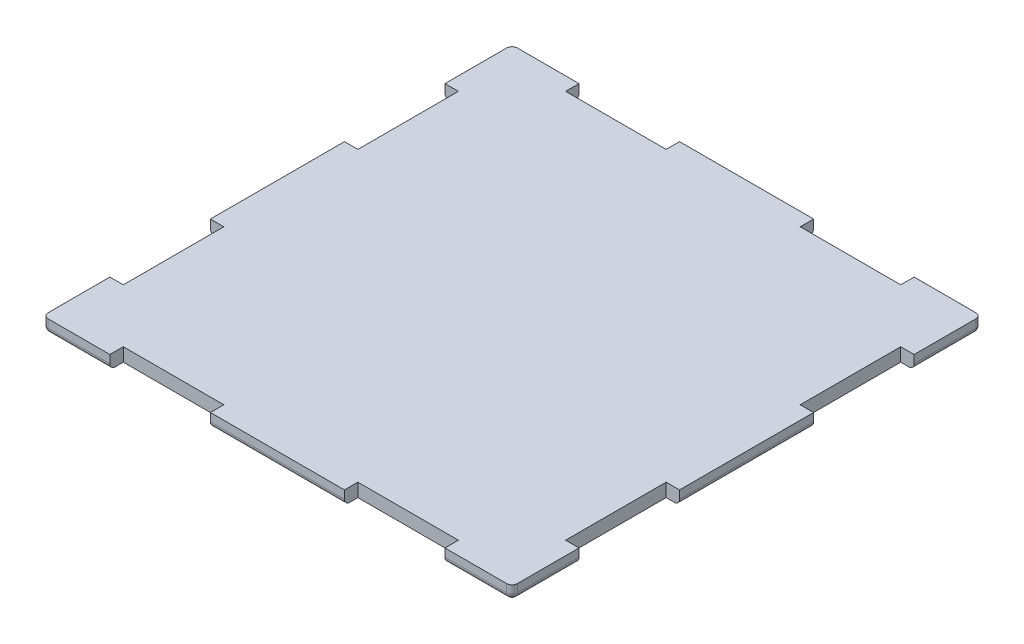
ISO-10303-21;
HEADER;
FILE_DESCRIPTION(('STEP AP214'),'2;1');
FILE_NAME('part.step','',(''),(''),'','','');
FILE_SCHEMA(('AUTOMOTIVE_DESIGN { 1 0 10303 214 1 1 1 1 }'));
ENDSEC;
DATA;
#1=APPLICATION_CONTEXT('core data for automotive mechanical design processes');
#2=APPLICATION_PROTOCOL_DEFINITION('international standard','automotive_design',2000,#1);
#3=PRODUCT_CONTEXT('',#1,'mechanical');
#4=PRODUCT('Part','Part','',(#3));
#5=PRODUCT_RELATED_PRODUCT_CATEGORY('part','',(#4));
#6=PRODUCT_DEFINITION_FORMATION('','',#4);
#7=PRODUCT_DEFINITION_CONTEXT('part definition',#1,'design');
#8=PRODUCT_DEFINITION('design','',#6,#7);
#9=PRODUCT_DEFINITION_SHAPE('','',#8);
#10=(LENGTH_UNIT() NAMED_UNIT(*) SI_UNIT(.MILLI.,.METRE.));
#11=(NAMED_UNIT(*) PLANE_ANGLE_UNIT() SI_UNIT($,.RADIAN.));
#12=(NAMED_UNIT(*) SI_UNIT($,.STERADIAN.) SOLID_ANGLE_UNIT());
#13=UNCERTAINTY_MEASURE_WITH_UNIT(LENGTH_MEASURE(1.E-05),#10,'distance_accuracy_value','');
#14=(GEOMETRIC_REPRESENTATION_CONTEXT(3) GLOBAL_UNCERTAINTY_ASSIGNED_CONTEXT((#13)) GLOBAL_UNIT_ASSIGNED_CONTEXT((#10,
#11,#12)) REPRESENTATION_CONTEXT('',''));
#15=CARTESIAN_POINT('',(0.,0.,0.));
#16=DIRECTION('',(0.,0.,1.));
#17=DIRECTION('',(1.,0.,0.));
#18=AXIS2_PLACEMENT_3D('',#15,#16,#17);
#19=CARTESIAN_POINT('',(-175.,10.,175.));
#20=DIRECTION('',(1.,0.,0.));
#21=DIRECTION('',(0.,0.,-1.));
#22=AXIS2_PLACEMENT_3D('',#19,#20,#21);
#23=PLANE('',#22);
#24=DIRECTION('',(0.,1.,0.));
#25=VECTOR('',#24,1.);
#26=CARTESIAN_POINT('',(-175.,0.,-50.0000000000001));
#27=LINE('',#26,#25);
#28=CARTESIAN_POINT('',(-175.,4.,-50.0000000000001));
#29=VERTEX_POINT('',#28);
#30=CARTESIAN_POINT('',(-175.,10.,-50.0000000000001));
#31=VERTEX_POINT('',#30);
#32=EDGE_CURVE('E551',#29,#31,#27,.T.);
#33=ORIENTED_EDGE('',*,*,#32,.F.);
#34=DIRECTION('',(0.,0.,1.));
#35=VECTOR('',#34,1.);
#36=CARTESIAN_POINT('',(-175.,4.,175.));
#37=LINE('',#36,#35);
#38=CARTESIAN_POINT('',(-175.,4.,49.9999999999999));
#39=VERTEX_POINT('',#38);
#40=EDGE_CURVE('E674',#29,#39,#37,.T.);
#41=ORIENTED_EDGE('',*,*,#40,.T.);
#42=DIRECTION('',(0.,1.,0.));
#43=VECTOR('',#42,1.);
#44=CARTESIAN_POINT('',(-175.,0.,49.9999999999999));
#45=LINE('',#44,#43);
#46=CARTESIAN_POINT('',(-175.,10.,49.9999999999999));
#47=VERTEX_POINT('',#46);
#48=EDGE_CURVE('E481',#39,#47,#45,.T.);
#49=ORIENTED_EDGE('',*,*,#48,.T.);
#50=DIRECTION('',(0.,0.,1.));
#51=VECTOR('',#50,1.);
#52=CARTESIAN_POINT('',(-175.,10.,175.));
#53=LINE('',#52,#51);
#54=EDGE_CURVE('E571',#31,#47,#53,.T.);
#55=ORIENTED_EDGE('',*,*,#54,.F.);
#56=EDGE_LOOP('',(#33,#41,#49,#55));
#57=FACE_BOUND('',#56,.T.);
#58=ADVANCED_FACE('F33',(#57),#23,.F.);
#59=CARTESIAN_POINT('',(175.,10.,175.));
#60=DIRECTION('',(0.,0.,-1.));
#61=DIRECTION('',(-1.,0.,0.));
#62=AXIS2_PLACEMENT_3D('',#59,#60,#61);
#63=PLANE('',#62);
#64=DIRECTION('',(0.,1.,0.));
#65=VECTOR('',#64,1.);
#66=CARTESIAN_POINT('',(-50.0000000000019,0.,175.));
#67=LINE('',#66,#65);
#68=CARTESIAN_POINT('',(-50.0000000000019,4.,175.));
#69=VERTEX_POINT('',#68);
#70=CARTESIAN_POINT('',(-50.0000000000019,10.,175.));
#71=VERTEX_POINT('',#70);
#72=EDGE_CURVE('E425',#69,#71,#67,.T.);
#73=ORIENTED_EDGE('',*,*,#72,.F.);
#74=DIRECTION('',(1.,0.,0.));
#75=VECTOR('',#74,1.);
#76=CARTESIAN_POINT('',(175.,4.,175.));
#77=LINE('',#76,#75);
#78=CARTESIAN_POINT('',(49.9999999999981,4.,175.000000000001));
#79=VERTEX_POINT('',#78);
#80=EDGE_CURVE('E689',#69,#79,#77,.T.);
#81=ORIENTED_EDGE('',*,*,#80,.T.);
#82=DIRECTION('',(0.,1.,0.));
#83=VECTOR('',#82,1.);
#84=CARTESIAN_POINT('',(49.9999999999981,0.,175.000000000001));
#85=LINE('',#84,#83);
#86=CARTESIAN_POINT('',(49.9999999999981,10.,175.000000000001));
#87=VERTEX_POINT('',#86);
#88=EDGE_CURVE('E430',#79,#87,#85,.T.);
#89=ORIENTED_EDGE('',*,*,#88,.T.);
#90=DIRECTION('',(1.,0.,0.));
#91=VECTOR('',#90,1.);
#92=CARTESIAN_POINT('',(175.,10.,175.));
#93=LINE('',#92,#91);
#94=EDGE_CURVE('E575',#71,#87,#93,.T.);
#95=ORIENTED_EDGE('',*,*,#94,.F.);
#96=EDGE_LOOP('',(#73,#81,#89,#95));
#97=FACE_BOUND('',#96,.T.);
#98=ADVANCED_FACE('F787',(#97),#63,.F.);
#99=CARTESIAN_POINT('',(-171.,10.,175.));
#100=VERTEX_POINT('',#99);
#101=CARTESIAN_POINT('',(-125.000000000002,10.,174.999999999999));
#102=VERTEX_POINT('',#101);
#103=EDGE_CURVE('E572',#100,#102,#93,.T.);
#104=ORIENTED_EDGE('',*,*,#103,.F.);
#105=DIRECTION('',(0.,-1.,0.));
#106=VECTOR('',#105,1.);
#107=CARTESIAN_POINT('',(-171.,10.,175.));
#108=LINE('',#107,#106);
#109=CARTESIAN_POINT('',(-171.,4.,175.));
#110=VERTEX_POINT('',#109);
#111=EDGE_CURVE('E587',#100,#110,#108,.T.);
#112=ORIENTED_EDGE('',*,*,#111,.T.);
#113=DIRECTION('',(1.,0.,0.));
#114=VECTOR('',#113,1.);
#115=CARTESIAN_POINT('',(175.,4.,175.));
#116=LINE('',#115,#114);
#117=CARTESIAN_POINT('',(-125.000000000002,4.,174.999999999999));
#118=VERTEX_POINT('',#117);
#119=EDGE_CURVE('E584',#110,#118,#116,.T.);
#120=ORIENTED_EDGE('',*,*,#119,.T.);
#121=DIRECTION('',(0.,1.,0.));
#122=VECTOR('',#121,1.);
#123=CARTESIAN_POINT('',(-125.000000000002,0.,174.999999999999));
#124=LINE('',#123,#122);
#125=EDGE_CURVE('E405',#118,#102,#124,.T.);
#126=ORIENTED_EDGE('',*,*,#125,.T.);
#127=EDGE_LOOP('',(#104,#112,#120,#126));
#128=FACE_BOUND('',#127,.T.);
#129=ADVANCED_FACE('F796',(#128),#63,.F.);
#130=CARTESIAN_POINT('',(175.,10.,175.));
#131=DIRECTION('',(-1.,0.,0.));
#132=DIRECTION('',(0.,0.,1.));
#133=AXIS2_PLACEMENT_3D('',#130,#131,#132);
#134=PLANE('',#133);
#135=DIRECTION('',(0.,1.,0.));
#136=VECTOR('',#135,1.);
#137=CARTESIAN_POINT('',(175.,0.,50.0000000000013));
#138=LINE('',#137,#136);
#139=CARTESIAN_POINT('',(175.,4.,50.0000000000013));
#140=VERTEX_POINT('',#139);
#141=CARTESIAN_POINT('',(175.,10.,50.0000000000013));
#142=VERTEX_POINT('',#141);
#143=EDGE_CURVE('E372',#140,#142,#138,.T.);
#144=ORIENTED_EDGE('',*,*,#143,.F.);
#145=DIRECTION('',(0.,0.,-1.));
#146=VECTOR('',#145,1.);
#147=CARTESIAN_POINT('',(175.,4.,175.));
#148=LINE('',#147,#146);
#149=CARTESIAN_POINT('',(175.,4.,-49.9999999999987));
#150=VERTEX_POINT('',#149);
#151=EDGE_CURVE('E635',#140,#150,#148,.T.);
#152=ORIENTED_EDGE('',*,*,#151,.T.);
#153=DIRECTION('',(0.,1.,0.));
#154=VECTOR('',#153,1.);
#155=CARTESIAN_POINT('',(175.,0.,-49.9999999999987));
#156=LINE('',#155,#154);
#157=CARTESIAN_POINT('',(175.,10.,-49.9999999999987));
#158=VERTEX_POINT('',#157);
#159=EDGE_CURVE('E385',#150,#158,#156,.T.);
#160=ORIENTED_EDGE('',*,*,#159,.T.);
#161=DIRECTION('',(0.,0.,-1.));
#162=VECTOR('',#161,1.);
#163=CARTESIAN_POINT('',(175.,10.,175.));
#164=LINE('',#163,#162);
#165=EDGE_CURVE('E580',#142,#158,#164,.T.);
#166=ORIENTED_EDGE('',*,*,#165,.F.);
#167=EDGE_LOOP('',(#144,#152,#160,#166));
#168=FACE_BOUND('',#167,.T.);
#169=ADVANCED_FACE('F891',(#168),#134,.F.);
#170=DIRECTION('',(0.,-1.,0.));
#171=VECTOR('',#170,1.);
#172=CARTESIAN_POINT('',(175.,10.,171.));
#173=LINE('',#172,#171);
#174=CARTESIAN_POINT('',(175.,10.,171.));
#175=VERTEX_POINT('',#174);
#176=CARTESIAN_POINT('',(175.,4.,171.));
#177=VERTEX_POINT('',#176);
#178=EDGE_CURVE('E642',#175,#177,#173,.T.);
#179=ORIENTED_EDGE('',*,*,#178,.T.);
#180=DIRECTION('',(0.,0.,-1.));
#181=VECTOR('',#180,1.);
#182=CARTESIAN_POINT('',(175.,4.,175.));
#183=LINE('',#182,#181);
#184=CARTESIAN_POINT('',(174.999999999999,4.,125.000000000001));
#185=VERTEX_POINT('',#184);
#186=EDGE_CURVE('E644',#177,#185,#183,.T.);
#187=ORIENTED_EDGE('',*,*,#186,.T.);
#188=DIRECTION('',(0.,1.,0.));
#189=VECTOR('',#188,1.);
#190=CARTESIAN_POINT('',(174.999999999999,0.,125.000000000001));
#191=LINE('',#190,#189);
#192=CARTESIAN_POINT('',(174.999999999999,10.,125.000000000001));
#193=VERTEX_POINT('',#192);
#194=EDGE_CURVE('E362',#185,#193,#191,.T.);
#195=ORIENTED_EDGE('',*,*,#194,.T.);
#196=EDGE_CURVE('E576',#175,#193,#164,.T.);
#197=ORIENTED_EDGE('',*,*,#196,.F.);
#198=EDGE_LOOP('',(#179,#187,#195,#197));
#199=FACE_BOUND('',#198,.T.);
#200=ADVANCED_FACE('F882',(#199),#134,.F.);
#201=CARTESIAN_POINT('',(175.,10.,-175.));
#202=DIRECTION('',(0.,0.,1.));
#203=DIRECTION('',(1.,0.,0.));
#204=AXIS2_PLACEMENT_3D('',#201,#202,#203);
#205=PLANE('',#204);
#206=DIRECTION('',(0.,1.,0.));
#207=VECTOR('',#206,1.);
#208=CARTESIAN_POINT('',(50.0000000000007,0.,-175.));
#209=LINE('',#208,#207);
#210=CARTESIAN_POINT('',(50.0000000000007,4.,-175.));
#211=VERTEX_POINT('',#210);
#212=CARTESIAN_POINT('',(50.0000000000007,10.,-175.));
#213=VERTEX_POINT('',#212);
#214=EDGE_CURVE('E476',#211,#213,#209,.T.);
#215=ORIENTED_EDGE('',*,*,#214,.F.);
#216=DIRECTION('',(-1.,0.,0.));
#217=VECTOR('',#216,1.);
#218=CARTESIAN_POINT('',(175.,4.,-175.));
#219=LINE('',#218,#217);
#220=CARTESIAN_POINT('',(-49.9999999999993,4.,-175.));
#221=VERTEX_POINT('',#220);
#222=EDGE_CURVE('E654',#211,#221,#219,.T.);
#223=ORIENTED_EDGE('',*,*,#222,.T.);
#224=DIRECTION('',(0.,1.,0.));
#225=VECTOR('',#224,1.);
#226=CARTESIAN_POINT('',(-49.9999999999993,0.,-175.));
#227=LINE('',#226,#225);
#228=CARTESIAN_POINT('',(-49.9999999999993,10.,-175.));
#229=VERTEX_POINT('',#228);
#230=EDGE_CURVE('E508',#221,#229,#227,.T.);
#231=ORIENTED_EDGE('',*,*,#230,.T.);
#232=DIRECTION('',(-1.,0.,0.));
#233=VECTOR('',#232,1.);
#234=CARTESIAN_POINT('',(175.,10.,-175.));
#235=LINE('',#234,#233);
#236=EDGE_CURVE('E585',#213,#229,#235,.T.);
#237=ORIENTED_EDGE('',*,*,#236,.F.);
#238=EDGE_LOOP('',(#215,#223,#231,#237));
#239=FACE_BOUND('',#238,.T.);
#240=ADVANCED_FACE('F766',(#239),#205,.F.);
#241=CARTESIAN_POINT('',(171.,10.,-175.));
#242=VERTEX_POINT('',#241);
#243=CARTESIAN_POINT('',(125.000000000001,10.,-175.));
#244=VERTEX_POINT('',#243);
#245=EDGE_CURVE('E581',#242,#244,#235,.T.);
#246=ORIENTED_EDGE('',*,*,#245,.F.);
#247=DIRECTION('',(0.,-1.,0.));
#248=VECTOR('',#247,1.);
#249=CARTESIAN_POINT('',(171.,10.,-175.));
#250=LINE('',#249,#248);
#251=CARTESIAN_POINT('',(171.,4.,-175.));
#252=VERTEX_POINT('',#251);
#253=EDGE_CURVE('E650',#242,#252,#250,.T.);
#254=ORIENTED_EDGE('',*,*,#253,.T.);
#255=DIRECTION('',(-1.,0.,0.));
#256=VECTOR('',#255,1.);
#257=CARTESIAN_POINT('',(175.,4.,-175.));
#258=LINE('',#257,#256);
#259=CARTESIAN_POINT('',(125.000000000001,4.,-175.));
#260=VERTEX_POINT('',#259);
#261=EDGE_CURVE('E648',#252,#260,#258,.T.);
#262=ORIENTED_EDGE('',*,*,#261,.T.);
#263=DIRECTION('',(0.,1.,0.));
#264=VECTOR('',#263,1.);
#265=CARTESIAN_POINT('',(125.000000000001,0.,-175.));
#266=LINE('',#265,#264);
#267=EDGE_CURVE('E486',#260,#244,#266,.T.);
#268=ORIENTED_EDGE('',*,*,#267,.T.);
#269=EDGE_LOOP('',(#246,#254,#262,#268));
#270=FACE_BOUND('',#269,.T.);
#271=ADVANCED_FACE('F803',(#270),#205,.F.);
#272=CARTESIAN_POINT('',(-175.,10.,-171.));
#273=VERTEX_POINT('',#272);
#274=CARTESIAN_POINT('',(-175.,10.,-125.));
#275=VERTEX_POINT('',#274);
#276=EDGE_CURVE('E567',#273,#275,#53,.T.);
#277=ORIENTED_EDGE('',*,*,#276,.F.);
#278=DIRECTION('',(0.,-1.,0.));
#279=VECTOR('',#278,1.);
#280=CARTESIAN_POINT('',(-175.,10.,-171.));
#281=LINE('',#280,#279);
#282=CARTESIAN_POINT('',(-175.,4.,-171.));
#283=VERTEX_POINT('',#282);
#284=EDGE_CURVE('E670',#273,#283,#281,.T.);
#285=ORIENTED_EDGE('',*,*,#284,.T.);
#286=DIRECTION('',(0.,0.,1.));
#287=VECTOR('',#286,1.);
#288=CARTESIAN_POINT('',(-175.,4.,175.));
#289=LINE('',#288,#287);
#290=CARTESIAN_POINT('',(-175.,4.,-125.));
#291=VERTEX_POINT('',#290);
#292=EDGE_CURVE('E668',#283,#291,#289,.T.);
#293=ORIENTED_EDGE('',*,*,#292,.T.);
#294=DIRECTION('',(0.,1.,0.));
#295=VECTOR('',#294,1.);
#296=CARTESIAN_POINT('',(-175.,0.,-125.));
#297=LINE('',#296,#295);
#298=EDGE_CURVE('E559',#291,#275,#297,.T.);
#299=ORIENTED_EDGE('',*,*,#298,.T.);
#300=EDGE_LOOP('',(#277,#285,#293,#299));
#301=FACE_BOUND('',#300,.T.);
#302=ADVANCED_FACE('F790',(#301),#23,.F.);
#303=DIRECTION('',(0.,0.,1.));
#304=VECTOR('',#303,1.);
#305=CARTESIAN_POINT('',(-175.,4.,175.));
#306=LINE('',#305,#304);
#307=CARTESIAN_POINT('',(-175.,4.,125.));
#308=VERTEX_POINT('',#307);
#309=CARTESIAN_POINT('',(-175.,4.,171.));
#310=VERTEX_POINT('',#309);
#311=EDGE_CURVE('E590',#308,#310,#306,.T.);
#312=ORIENTED_EDGE('',*,*,#311,.T.);
#313=DIRECTION('',(0.,-1.,0.));
#314=VECTOR('',#313,1.);
#315=CARTESIAN_POINT('',(-175.,10.,171.));
#316=LINE('',#315,#314);
#317=CARTESIAN_POINT('',(-175.,10.,171.));
#318=VERTEX_POINT('',#317);
#319=EDGE_CURVE('E592',#310,#318,#316,.F.);
#320=ORIENTED_EDGE('',*,*,#319,.T.);
#321=CARTESIAN_POINT('',(-175.,10.,125.));
#322=VERTEX_POINT('',#321);
#323=EDGE_CURVE('E561',#322,#318,#53,.T.);
#324=ORIENTED_EDGE('',*,*,#323,.F.);
#325=DIRECTION('',(0.,1.,0.));
#326=VECTOR('',#325,1.);
#327=CARTESIAN_POINT('',(-175.,0.,125.));
#328=LINE('',#327,#326);
#329=EDGE_CURVE('E503',#308,#322,#328,.T.);
#330=ORIENTED_EDGE('',*,*,#329,.F.);
#331=EDGE_LOOP('',(#312,#320,#324,#330));
#332=FACE_BOUND('',#331,.T.);
#333=ADVANCED_FACE('F791',(#332),#23,.F.);
#334=DIRECTION('',(0.,1.,0.));
#335=VECTOR('',#334,1.);
#336=CARTESIAN_POINT('',(124.999999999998,0.,175.000000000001));
#337=LINE('',#336,#335);
#338=CARTESIAN_POINT('',(124.999999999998,4.,175.000000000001));
#339=VERTEX_POINT('',#338);
#340=CARTESIAN_POINT('',(124.999999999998,10.,175.000000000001));
#341=VERTEX_POINT('',#340);
#342=EDGE_CURVE('E451',#339,#341,#337,.T.);
#343=ORIENTED_EDGE('',*,*,#342,.F.);
#344=DIRECTION('',(1.,0.,0.));
#345=VECTOR('',#344,1.);
#346=CARTESIAN_POINT('',(175.,4.,175.));
#347=LINE('',#346,#345);
#348=CARTESIAN_POINT('',(171.,4.,175.));
#349=VERTEX_POINT('',#348);
#350=EDGE_CURVE('E685',#339,#349,#347,.T.);
#351=ORIENTED_EDGE('',*,*,#350,.T.);
#352=DIRECTION('',(0.,-1.,0.));
#353=VECTOR('',#352,1.);
#354=CARTESIAN_POINT('',(171.,10.,175.));
#355=LINE('',#354,#353);
#356=CARTESIAN_POINT('',(171.,10.,175.));
#357=VERTEX_POINT('',#356);
#358=EDGE_CURVE('E683',#349,#357,#355,.F.);
#359=ORIENTED_EDGE('',*,*,#358,.T.);
#360=EDGE_CURVE('E570',#341,#357,#93,.T.);
#361=ORIENTED_EDGE('',*,*,#360,.F.);
#362=EDGE_LOOP('',(#343,#351,#359,#361));
#363=FACE_BOUND('',#362,.T.);
#364=ADVANCED_FACE('F799',(#363),#63,.F.);
#365=DIRECTION('',(0.,1.,0.));
#366=VECTOR('',#365,1.);
#367=CARTESIAN_POINT('',(175.000000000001,0.,-124.999999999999));
#368=LINE('',#367,#366);
#369=CARTESIAN_POINT('',(175.000000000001,4.,-124.999999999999));
#370=VERTEX_POINT('',#369);
#371=CARTESIAN_POINT('',(175.000000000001,10.,-124.999999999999));
#372=VERTEX_POINT('',#371);
#373=EDGE_CURVE('E400',#370,#372,#368,.T.);
#374=ORIENTED_EDGE('',*,*,#373,.F.);
#375=DIRECTION('',(0.,0.,-1.));
#376=VECTOR('',#375,1.);
#377=CARTESIAN_POINT('',(175.,4.,175.));
#378=LINE('',#377,#376);
#379=CARTESIAN_POINT('',(175.,4.,-171.));
#380=VERTEX_POINT('',#379);
#381=EDGE_CURVE('E630',#370,#380,#378,.T.);
#382=ORIENTED_EDGE('',*,*,#381,.T.);
#383=DIRECTION('',(0.,-1.,0.));
#384=VECTOR('',#383,1.);
#385=CARTESIAN_POINT('',(175.,10.,-171.));
#386=LINE('',#385,#384);
#387=CARTESIAN_POINT('',(175.,10.,-171.));
#388=VERTEX_POINT('',#387);
#389=EDGE_CURVE('E628',#380,#388,#386,.F.);
#390=ORIENTED_EDGE('',*,*,#389,.T.);
#391=EDGE_CURVE('E574',#372,#388,#164,.T.);
#392=ORIENTED_EDGE('',*,*,#391,.F.);
#393=EDGE_LOOP('',(#374,#382,#390,#392));
#394=FACE_BOUND('',#393,.T.);
#395=ADVANCED_FACE('F810',(#394),#134,.F.);
#396=DIRECTION('',(0.,1.,0.));
#397=VECTOR('',#396,1.);
#398=CARTESIAN_POINT('',(-124.999999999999,0.,-175.000000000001));
#399=LINE('',#398,#397);
#400=CARTESIAN_POINT('',(-124.999999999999,4.,-175.000000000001));
#401=VERTEX_POINT('',#400);
#402=CARTESIAN_POINT('',(-124.999999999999,10.,-175.000000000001));
#403=VERTEX_POINT('',#402);
#404=EDGE_CURVE('E528',#401,#403,#399,.T.);
#405=ORIENTED_EDGE('',*,*,#404,.F.);
#406=DIRECTION('',(-1.,0.,0.));
#407=VECTOR('',#406,1.);
#408=CARTESIAN_POINT('',(175.,4.,-175.));
#409=LINE('',#408,#407);
#410=CARTESIAN_POINT('',(-171.,4.,-175.));
#411=VERTEX_POINT('',#410);
#412=EDGE_CURVE('E663',#401,#411,#409,.T.);
#413=ORIENTED_EDGE('',*,*,#412,.T.);
#414=DIRECTION('',(0.,-1.,0.));
#415=VECTOR('',#414,1.);
#416=CARTESIAN_POINT('',(-171.,10.,-175.));
#417=LINE('',#416,#415);
#418=CARTESIAN_POINT('',(-171.,10.,-175.));
#419=VERTEX_POINT('',#418);
#420=EDGE_CURVE('E661',#411,#419,#417,.F.);
#421=ORIENTED_EDGE('',*,*,#420,.T.);
#422=EDGE_CURVE('E579',#403,#419,#235,.T.);
#423=ORIENTED_EDGE('',*,*,#422,.F.);
#424=EDGE_LOOP('',(#405,#413,#421,#423));
#425=FACE_BOUND('',#424,.T.);
#426=ADVANCED_FACE('F735',(#425),#205,.F.);
#427=CARTESIAN_POINT('',(0.,10.,0.));
#428=DIRECTION('',(0.,1.,0.));
#429=DIRECTION('',(0.,0.,1.));
#430=AXIS2_PLACEMENT_3D('',#427,#428,#429);
#431=PLANE('',#430);
#432=ORIENTED_EDGE('',*,*,#323,.T.);
#433=CARTESIAN_POINT('',(-171.,10.,171.));
#434=DIRECTION('',(0.,1.,0.));
#435=DIRECTION('',(0.,0.,1.));
#436=AXIS2_PLACEMENT_3D('',#433,#434,#435);
#437=CIRCLE('',#436,4.);
#438=EDGE_CURVE('E600',#318,#100,#437,.T.);
#439=ORIENTED_EDGE('',*,*,#438,.T.);
#440=ORIENTED_EDGE('',*,*,#103,.T.);
#441=DIRECTION('',(0.,0.,1.));
#442=VECTOR('',#441,1.);
#443=CARTESIAN_POINT('',(-125.000000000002,10.,174.999999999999));
#444=LINE('',#443,#442);
#445=CARTESIAN_POINT('',(-125.000000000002,10.,164.999999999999));
#446=VERTEX_POINT('',#445);
#447=EDGE_CURVE('E419',#446,#102,#444,.T.);
#448=ORIENTED_EDGE('',*,*,#447,.F.);
#449=DIRECTION('',(-1.,0.,0.));
#450=VECTOR('',#449,1.);
#451=CARTESIAN_POINT('',(-125.000000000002,10.,164.999999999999));
#452=LINE('',#451,#450);
#453=CARTESIAN_POINT('',(-50.0000000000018,10.,165.));
#454=VERTEX_POINT('',#453);
#455=EDGE_CURVE('E429',#454,#446,#452,.T.);
#456=ORIENTED_EDGE('',*,*,#455,.F.);
#457=DIRECTION('',(0.,0.,-1.));
#458=VECTOR('',#457,1.);
#459=CARTESIAN_POINT('',(-50.0000000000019,10.,175.));
#460=LINE('',#459,#458);
#461=EDGE_CURVE('E426',#71,#454,#460,.T.);
#462=ORIENTED_EDGE('',*,*,#461,.F.);
#463=ORIENTED_EDGE('',*,*,#94,.T.);
#464=DIRECTION('',(0.,0.,1.));
#465=VECTOR('',#464,1.);
#466=CARTESIAN_POINT('',(49.9999999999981,10.,175.000000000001));
#467=LINE('',#466,#465);
#468=CARTESIAN_POINT('',(49.9999999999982,10.,165.000000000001));
#469=VERTEX_POINT('',#468);
#470=EDGE_CURVE('E445',#469,#87,#467,.T.);
#471=ORIENTED_EDGE('',*,*,#470,.F.);
#472=DIRECTION('',(-1.,0.,0.));
#473=VECTOR('',#472,1.);
#474=CARTESIAN_POINT('',(49.9999999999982,10.,165.000000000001));
#475=LINE('',#474,#473);
#476=CARTESIAN_POINT('',(124.999999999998,10.,165.000000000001));
#477=VERTEX_POINT('',#476);
#478=EDGE_CURVE('E455',#477,#469,#475,.T.);
#479=ORIENTED_EDGE('',*,*,#478,.F.);
#480=DIRECTION('',(0.,0.,-1.));
#481=VECTOR('',#480,1.);
#482=CARTESIAN_POINT('',(124.999999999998,10.,175.000000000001));
#483=LINE('',#482,#481);
#484=EDGE_CURVE('E452',#341,#477,#483,.T.);
#485=ORIENTED_EDGE('',*,*,#484,.F.);
#486=ORIENTED_EDGE('',*,*,#360,.T.);
#487=CARTESIAN_POINT('',(171.,10.,171.));
#488=DIRECTION('',(0.,1.,0.));
#489=DIRECTION('',(0.,0.,1.));
#490=AXIS2_PLACEMENT_3D('',#487,#488,#489);
#491=CIRCLE('',#490,4.);
#492=EDGE_CURVE('E594',#357,#175,#491,.T.);
#493=ORIENTED_EDGE('',*,*,#492,.T.);
#494=ORIENTED_EDGE('',*,*,#196,.T.);
#495=DIRECTION('',(1.,0.,0.));
#496=VECTOR('',#495,1.);
#497=CARTESIAN_POINT('',(174.999999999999,10.,125.000000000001));
#498=LINE('',#497,#496);
#499=CARTESIAN_POINT('',(164.999999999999,10.,125.000000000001));
#500=VERTEX_POINT('',#499);
#501=EDGE_CURVE('E379',#500,#193,#498,.T.);
#502=ORIENTED_EDGE('',*,*,#501,.F.);
#503=DIRECTION('',(0.,0.,1.));
#504=VECTOR('',#503,1.);
#505=CARTESIAN_POINT('',(164.999999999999,10.,125.000000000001));
#506=LINE('',#505,#504);
#507=CARTESIAN_POINT('',(165.,10.,50.0000000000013));
#508=VERTEX_POINT('',#507);
#509=EDGE_CURVE('E358',#508,#500,#506,.T.);
#510=ORIENTED_EDGE('',*,*,#509,.F.);
#511=DIRECTION('',(-1.,0.,0.));
#512=VECTOR('',#511,1.);
#513=CARTESIAN_POINT('',(175.,10.,50.0000000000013));
#514=LINE('',#513,#512);
#515=EDGE_CURVE('E382',#142,#508,#514,.T.);
#516=ORIENTED_EDGE('',*,*,#515,.F.);
#517=ORIENTED_EDGE('',*,*,#165,.T.);
#518=DIRECTION('',(1.,0.,0.));
#519=VECTOR('',#518,1.);
#520=CARTESIAN_POINT('',(175.,10.,-49.9999999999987));
#521=LINE('',#520,#519);
#522=CARTESIAN_POINT('',(165.,10.,-49.9999999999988));
#523=VERTEX_POINT('',#522);
#524=EDGE_CURVE('E395',#523,#158,#521,.T.);
#525=ORIENTED_EDGE('',*,*,#524,.F.);
#526=DIRECTION('',(0.,0.,1.));
#527=VECTOR('',#526,1.);
#528=CARTESIAN_POINT('',(165.,10.,-49.9999999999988));
#529=LINE('',#528,#527);
#530=CARTESIAN_POINT('',(165.000000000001,10.,-124.999999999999));
#531=VERTEX_POINT('',#530);
#532=EDGE_CURVE('E404',#531,#523,#529,.T.);
#533=ORIENTED_EDGE('',*,*,#532,.F.);
#534=DIRECTION('',(-1.,0.,0.));
#535=VECTOR('',#534,1.);
#536=CARTESIAN_POINT('',(175.000000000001,10.,-124.999999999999));
#537=LINE('',#536,#535);
#538=EDGE_CURVE('E401',#372,#531,#537,.T.);
#539=ORIENTED_EDGE('',*,*,#538,.F.);
#540=ORIENTED_EDGE('',*,*,#391,.T.);
#541=CARTESIAN_POINT('',(171.,10.,-171.));
#542=DIRECTION('',(0.,1.,0.));
#543=DIRECTION('',(0.,0.,1.));
#544=AXIS2_PLACEMENT_3D('',#541,#542,#543);
#545=CIRCLE('',#544,4.);
#546=EDGE_CURVE('E598',#388,#242,#545,.T.);
#547=ORIENTED_EDGE('',*,*,#546,.T.);
#548=ORIENTED_EDGE('',*,*,#245,.T.);
#549=DIRECTION('',(0.,0.,-1.));
#550=VECTOR('',#549,1.);
#551=CARTESIAN_POINT('',(125.000000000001,10.,-175.));
#552=LINE('',#551,#550);
#553=CARTESIAN_POINT('',(125.000000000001,10.,-165.));
#554=VERTEX_POINT('',#553);
#555=EDGE_CURVE('E470',#554,#244,#552,.T.);
#556=ORIENTED_EDGE('',*,*,#555,.F.);
#557=DIRECTION('',(1.,0.,0.));
#558=VECTOR('',#557,1.);
#559=CARTESIAN_POINT('',(125.000000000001,10.,-165.));
#560=LINE('',#559,#558);
#561=CARTESIAN_POINT('',(50.0000000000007,10.,-165.));
#562=VERTEX_POINT('',#561);
#563=EDGE_CURVE('E480',#562,#554,#560,.T.);
#564=ORIENTED_EDGE('',*,*,#563,.F.);
#565=DIRECTION('',(0.,0.,1.));
#566=VECTOR('',#565,1.);
#567=CARTESIAN_POINT('',(50.0000000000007,10.,-175.));
#568=LINE('',#567,#566);
#569=EDGE_CURVE('E477',#213,#562,#568,.T.);
#570=ORIENTED_EDGE('',*,*,#569,.F.);
#571=ORIENTED_EDGE('',*,*,#236,.T.);
#572=DIRECTION('',(0.,0.,-1.));
#573=VECTOR('',#572,1.);
#574=CARTESIAN_POINT('',(-49.9999999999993,10.,-175.));
#575=LINE('',#574,#573);
#576=CARTESIAN_POINT('',(-49.9999999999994,10.,-165.));
#577=VERTEX_POINT('',#576);
#578=EDGE_CURVE('E522',#577,#229,#575,.T.);
#579=ORIENTED_EDGE('',*,*,#578,.F.);
#580=DIRECTION('',(1.,0.,0.));
#581=VECTOR('',#580,1.);
#582=CARTESIAN_POINT('',(-49.9999999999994,10.,-165.));
#583=LINE('',#582,#581);
#584=CARTESIAN_POINT('',(-124.999999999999,10.,-165.000000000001));
#585=VERTEX_POINT('',#584);
#586=EDGE_CURVE('E531',#585,#577,#583,.T.);
#587=ORIENTED_EDGE('',*,*,#586,.F.);
#588=DIRECTION('',(0.,0.,1.));
#589=VECTOR('',#588,1.);
#590=CARTESIAN_POINT('',(-124.999999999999,10.,-175.000000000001));
#591=LINE('',#590,#589);
#592=EDGE_CURVE('E388',#403,#585,#591,.T.);
#593=ORIENTED_EDGE('',*,*,#592,.F.);
#594=ORIENTED_EDGE('',*,*,#422,.T.);
#595=CARTESIAN_POINT('',(-171.,10.,-171.));
#596=DIRECTION('',(0.,1.,0.));
#597=DIRECTION('',(0.,0.,1.));
#598=AXIS2_PLACEMENT_3D('',#595,#596,#597);
#599=CIRCLE('',#598,4.);
#600=EDGE_CURVE('E596',#419,#273,#599,.T.);
#601=ORIENTED_EDGE('',*,*,#600,.T.);
#602=ORIENTED_EDGE('',*,*,#276,.T.);
#603=DIRECTION('',(-1.,0.,0.));
#604=VECTOR('',#603,1.);
#605=CARTESIAN_POINT('',(-175.,10.,-125.));
#606=LINE('',#605,#604);
#607=CARTESIAN_POINT('',(-165.,10.,-125.));
#608=VERTEX_POINT('',#607);
#609=EDGE_CURVE('E545',#608,#275,#606,.T.);
#610=ORIENTED_EDGE('',*,*,#609,.F.);
#611=DIRECTION('',(0.,0.,-1.));
#612=VECTOR('',#611,1.);
#613=CARTESIAN_POINT('',(-165.,10.,-125.));
#614=LINE('',#613,#612);
#615=CARTESIAN_POINT('',(-165.,10.,-50.0000000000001));
#616=VERTEX_POINT('',#615);
#617=EDGE_CURVE('E554',#616,#608,#614,.T.);
#618=ORIENTED_EDGE('',*,*,#617,.F.);
#619=DIRECTION('',(1.,0.,0.));
#620=VECTOR('',#619,1.);
#621=CARTESIAN_POINT('',(-175.,10.,-50.0000000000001));
#622=LINE('',#621,#620);
#623=EDGE_CURVE('E488',#31,#616,#622,.T.);
#624=ORIENTED_EDGE('',*,*,#623,.F.);
#625=ORIENTED_EDGE('',*,*,#54,.T.);
#626=DIRECTION('',(-1.,0.,0.));
#627=VECTOR('',#626,1.);
#628=CARTESIAN_POINT('',(-175.,10.,49.9999999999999));
#629=LINE('',#628,#627);
#630=CARTESIAN_POINT('',(-165.,10.,49.9999999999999));
#631=VERTEX_POINT('',#630);
#632=EDGE_CURVE('E497',#631,#47,#629,.T.);
#633=ORIENTED_EDGE('',*,*,#632,.F.);
#634=DIRECTION('',(0.,0.,-1.));
#635=VECTOR('',#634,1.);
#636=CARTESIAN_POINT('',(-165.,10.,49.9999999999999));
#637=LINE('',#636,#635);
#638=CARTESIAN_POINT('',(-165.,10.,125.));
#639=VERTEX_POINT('',#638);
#640=EDGE_CURVE('E507',#639,#631,#637,.T.);
#641=ORIENTED_EDGE('',*,*,#640,.F.);
#642=DIRECTION('',(1.,0.,0.));
#643=VECTOR('',#642,1.);
#644=CARTESIAN_POINT('',(-175.,10.,125.));
#645=LINE('',#644,#643);
#646=EDGE_CURVE('E504',#322,#639,#645,.T.);
#647=ORIENTED_EDGE('',*,*,#646,.F.);
#648=EDGE_LOOP('',(#432,#439,#440,#448,#456,#462,#463,#471,#479,#485,#486,#493,#494,#502,#510,
#516,#517,#525,#533,#539,#540,#547,#548,#556,#564,#570,#571,#579,#587,#593,#594,#601,#602,#610,
#618,#624,#625,#633,#641,#647));
#649=FACE_BOUND('',#648,.T.);
#650=ADVANCED_FACE('F771',(#649),#431,.T.);
#651=CARTESIAN_POINT('',(0.,0.,0.));
#652=DIRECTION('',(0.,1.,0.));
#653=DIRECTION('',(0.,0.,1.));
#654=AXIS2_PLACEMENT_3D('',#651,#652,#653);
#655=PLANE('',#654);
#656=DIRECTION('',(1.,0.,0.));
#657=VECTOR('',#656,1.);
#658=CARTESIAN_POINT('',(175.,0.,-49.9999999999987));
#659=LINE('',#658,#657);
#660=CARTESIAN_POINT('',(165.,0.,-49.9999999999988));
#661=VERTEX_POINT('',#660);
#662=CARTESIAN_POINT('',(171.,0.,-49.9999999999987));
#663=VERTEX_POINT('',#662);
#664=EDGE_CURVE('E398',#661,#663,#659,.T.);
#665=ORIENTED_EDGE('',*,*,#664,.T.);
#666=DIRECTION('',(0.,0.,-1.));
#667=VECTOR('',#666,1.);
#668=CARTESIAN_POINT('',(171.,0.,0.));
#669=LINE('',#668,#667);
#670=CARTESIAN_POINT('',(171.,0.,50.0000000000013));
#671=VERTEX_POINT('',#670);
#672=EDGE_CURVE('E624',#663,#671,#669,.F.);
#673=ORIENTED_EDGE('',*,*,#672,.T.);
#674=DIRECTION('',(-1.,0.,0.));
#675=VECTOR('',#674,1.);
#676=CARTESIAN_POINT('',(175.,0.,50.0000000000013));
#677=LINE('',#676,#675);
#678=CARTESIAN_POINT('',(165.,0.,50.0000000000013));
#679=VERTEX_POINT('',#678);
#680=EDGE_CURVE('E377',#671,#679,#677,.T.);
#681=ORIENTED_EDGE('',*,*,#680,.T.);
#682=DIRECTION('',(0.,0.,1.));
#683=VECTOR('',#682,1.);
#684=CARTESIAN_POINT('',(164.999999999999,0.,125.000000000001));
#685=LINE('',#684,#683);
#686=CARTESIAN_POINT('',(164.999999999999,0.,125.000000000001));
#687=VERTEX_POINT('',#686);
#688=EDGE_CURVE('E355',#679,#687,#685,.T.);
#689=ORIENTED_EDGE('',*,*,#688,.T.);
#690=DIRECTION('',(1.,0.,0.));
#691=VECTOR('',#690,1.);
#692=CARTESIAN_POINT('',(174.999999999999,0.,125.000000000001));
#693=LINE('',#692,#691);
#694=CARTESIAN_POINT('',(171.,0.,125.000000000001));
#695=VERTEX_POINT('',#694);
#696=EDGE_CURVE('E366',#687,#695,#693,.T.);
#697=ORIENTED_EDGE('',*,*,#696,.T.);
#698=DIRECTION('',(0.,0.,-1.));
#699=VECTOR('',#698,1.);
#700=CARTESIAN_POINT('',(171.,0.,0.));
#701=LINE('',#700,#699);
#702=CARTESIAN_POINT('',(171.,0.,171.));
#703=VERTEX_POINT('',#702);
#704=EDGE_CURVE('E606',#695,#703,#701,.F.);
#705=ORIENTED_EDGE('',*,*,#704,.T.);
#706=DIRECTION('',(1.,0.,0.));
#707=VECTOR('',#706,1.);
#708=CARTESIAN_POINT('',(0.,0.,171.));
#709=LINE('',#708,#707);
#710=CARTESIAN_POINT('',(124.999999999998,0.,171.));
#711=VERTEX_POINT('',#710);
#712=EDGE_CURVE('E604',#703,#711,#709,.F.);
#713=ORIENTED_EDGE('',*,*,#712,.T.);
#714=DIRECTION('',(0.,0.,-1.));
#715=VECTOR('',#714,1.);
#716=CARTESIAN_POINT('',(124.999999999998,0.,175.000000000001));
#717=LINE('',#716,#715);
#718=CARTESIAN_POINT('',(124.999999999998,0.,165.000000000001));
#719=VERTEX_POINT('',#718);
#720=EDGE_CURVE('E442',#711,#719,#717,.T.);
#721=ORIENTED_EDGE('',*,*,#720,.T.);
#722=DIRECTION('',(-1.,0.,0.));
#723=VECTOR('',#722,1.);
#724=CARTESIAN_POINT('',(49.9999999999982,0.,165.000000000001));
#725=LINE('',#724,#723);
#726=CARTESIAN_POINT('',(49.9999999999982,0.,165.000000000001));
#727=VERTEX_POINT('',#726);
#728=EDGE_CURVE('E444',#719,#727,#725,.T.);
#729=ORIENTED_EDGE('',*,*,#728,.T.);
#730=DIRECTION('',(0.,0.,1.));
#731=VECTOR('',#730,1.);
#732=CARTESIAN_POINT('',(49.9999999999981,0.,175.000000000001));
#733=LINE('',#732,#731);
#734=CARTESIAN_POINT('',(49.9999999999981,0.,171.));
#735=VERTEX_POINT('',#734);
#736=EDGE_CURVE('E448',#727,#735,#733,.T.);
#737=ORIENTED_EDGE('',*,*,#736,.T.);
#738=DIRECTION('',(1.,0.,0.));
#739=VECTOR('',#738,1.);
#740=CARTESIAN_POINT('',(0.,0.,171.));
#741=LINE('',#740,#739);
#742=CARTESIAN_POINT('',(-50.0000000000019,0.,171.));
#743=VERTEX_POINT('',#742);
#744=EDGE_CURVE('E602',#735,#743,#741,.F.);
#745=ORIENTED_EDGE('',*,*,#744,.T.);
#746=DIRECTION('',(0.,0.,-1.));
#747=VECTOR('',#746,1.);
#748=CARTESIAN_POINT('',(-50.0000000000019,0.,175.));
#749=LINE('',#748,#747);
#750=CARTESIAN_POINT('',(-50.0000000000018,0.,165.));
#751=VERTEX_POINT('',#750);
#752=EDGE_CURVE('E416',#743,#751,#749,.T.);
#753=ORIENTED_EDGE('',*,*,#752,.T.);
#754=DIRECTION('',(-1.,0.,0.));
#755=VECTOR('',#754,1.);
#756=CARTESIAN_POINT('',(-125.000000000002,0.,164.999999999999));
#757=LINE('',#756,#755);
#758=CARTESIAN_POINT('',(-125.000000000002,0.,164.999999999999));
#759=VERTEX_POINT('',#758);
#760=EDGE_CURVE('E418',#751,#759,#757,.T.);
#761=ORIENTED_EDGE('',*,*,#760,.T.);
#762=DIRECTION('',(0.,0.,1.));
#763=VECTOR('',#762,1.);
#764=CARTESIAN_POINT('',(-125.000000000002,0.,174.999999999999));
#765=LINE('',#764,#763);
#766=CARTESIAN_POINT('',(-125.000000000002,0.,171.));
#767=VERTEX_POINT('',#766);
#768=EDGE_CURVE('E422',#759,#767,#765,.T.);
#769=ORIENTED_EDGE('',*,*,#768,.T.);
#770=DIRECTION('',(1.,0.,0.));
#771=VECTOR('',#770,1.);
#772=CARTESIAN_POINT('',(0.,0.,171.));
#773=LINE('',#772,#771);
#774=CARTESIAN_POINT('',(-171.,0.,171.));
#775=VERTEX_POINT('',#774);
#776=EDGE_CURVE('E608',#767,#775,#773,.F.);
#777=ORIENTED_EDGE('',*,*,#776,.T.);
#778=DIRECTION('',(0.,0.,1.));
#779=VECTOR('',#778,1.);
#780=CARTESIAN_POINT('',(-171.,0.,0.));
#781=LINE('',#780,#779);
#782=CARTESIAN_POINT('',(-171.,0.,125.));
#783=VERTEX_POINT('',#782);
#784=EDGE_CURVE('E610',#775,#783,#781,.F.);
#785=ORIENTED_EDGE('',*,*,#784,.T.);
#786=DIRECTION('',(1.,0.,0.));
#787=VECTOR('',#786,1.);
#788=CARTESIAN_POINT('',(-175.,0.,125.));
#789=LINE('',#788,#787);
#790=CARTESIAN_POINT('',(-165.,0.,125.));
#791=VERTEX_POINT('',#790);
#792=EDGE_CURVE('E494',#783,#791,#789,.T.);
#793=ORIENTED_EDGE('',*,*,#792,.T.);
#794=DIRECTION('',(0.,0.,-1.));
#795=VECTOR('',#794,1.);
#796=CARTESIAN_POINT('',(-165.,0.,49.9999999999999));
#797=LINE('',#796,#795);
#798=CARTESIAN_POINT('',(-165.,0.,49.9999999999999));
#799=VERTEX_POINT('',#798);
#800=EDGE_CURVE('E496',#791,#799,#797,.T.);
#801=ORIENTED_EDGE('',*,*,#800,.T.);
#802=DIRECTION('',(-1.,0.,0.));
#803=VECTOR('',#802,1.);
#804=CARTESIAN_POINT('',(-175.,0.,49.9999999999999));
#805=LINE('',#804,#803);
#806=CARTESIAN_POINT('',(-171.,0.,49.9999999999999));
#807=VERTEX_POINT('',#806);
#808=EDGE_CURVE('E500',#799,#807,#805,.T.);
#809=ORIENTED_EDGE('',*,*,#808,.T.);
#810=DIRECTION('',(0.,0.,1.));
#811=VECTOR('',#810,1.);
#812=CARTESIAN_POINT('',(-171.,0.,0.));
#813=LINE('',#812,#811);
#814=CARTESIAN_POINT('',(-171.,0.,-50.0000000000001));
#815=VERTEX_POINT('',#814);
#816=EDGE_CURVE('E612',#807,#815,#813,.F.);
#817=ORIENTED_EDGE('',*,*,#816,.T.);
#818=DIRECTION('',(1.,0.,0.));
#819=VECTOR('',#818,1.);
#820=CARTESIAN_POINT('',(-175.,0.,-50.0000000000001));
#821=LINE('',#820,#819);
#822=CARTESIAN_POINT('',(-165.,0.,-50.0000000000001));
#823=VERTEX_POINT('',#822);
#824=EDGE_CURVE('E542',#815,#823,#821,.T.);
#825=ORIENTED_EDGE('',*,*,#824,.T.);
#826=DIRECTION('',(0.,0.,-1.));
#827=VECTOR('',#826,1.);
#828=CARTESIAN_POINT('',(-165.,0.,-125.));
#829=LINE('',#828,#827);
#830=CARTESIAN_POINT('',(-165.,0.,-125.));
#831=VERTEX_POINT('',#830);
#832=EDGE_CURVE('E544',#823,#831,#829,.T.);
#833=ORIENTED_EDGE('',*,*,#832,.T.);
#834=DIRECTION('',(-1.,0.,0.));
#835=VECTOR('',#834,1.);
#836=CARTESIAN_POINT('',(-175.,0.,-125.));
#837=LINE('',#836,#835);
#838=CARTESIAN_POINT('',(-171.,0.,-125.));
#839=VERTEX_POINT('',#838);
#840=EDGE_CURVE('E548',#831,#839,#837,.T.);
#841=ORIENTED_EDGE('',*,*,#840,.T.);
#842=DIRECTION('',(0.,0.,1.));
#843=VECTOR('',#842,1.);
#844=CARTESIAN_POINT('',(-171.,0.,0.));
#845=LINE('',#844,#843);
#846=CARTESIAN_POINT('',(-171.,0.,-171.));
#847=VERTEX_POINT('',#846);
#848=EDGE_CURVE('E614',#839,#847,#845,.F.);
#849=ORIENTED_EDGE('',*,*,#848,.T.);
#850=DIRECTION('',(-1.,0.,0.));
#851=VECTOR('',#850,1.);
#852=CARTESIAN_POINT('',(0.,0.,-171.));
#853=LINE('',#852,#851);
#854=CARTESIAN_POINT('',(-124.999999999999,0.,-171.));
#855=VERTEX_POINT('',#854);
#856=EDGE_CURVE('E616',#847,#855,#853,.F.);
#857=ORIENTED_EDGE('',*,*,#856,.T.);
#858=DIRECTION('',(0.,0.,1.));
#859=VECTOR('',#858,1.);
#860=CARTESIAN_POINT('',(-124.999999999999,0.,-175.000000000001));
#861=LINE('',#860,#859);
#862=CARTESIAN_POINT('',(-124.999999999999,0.,-165.000000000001));
#863=VERTEX_POINT('',#862);
#864=EDGE_CURVE('E519',#855,#863,#861,.T.);
#865=ORIENTED_EDGE('',*,*,#864,.T.);
#866=DIRECTION('',(1.,0.,0.));
#867=VECTOR('',#866,1.);
#868=CARTESIAN_POINT('',(-49.9999999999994,0.,-165.));
#869=LINE('',#868,#867);
#870=CARTESIAN_POINT('',(-49.9999999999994,0.,-165.));
#871=VERTEX_POINT('',#870);
#872=EDGE_CURVE('E521',#863,#871,#869,.T.);
#873=ORIENTED_EDGE('',*,*,#872,.T.);
#874=DIRECTION('',(0.,0.,-1.));
#875=VECTOR('',#874,1.);
#876=CARTESIAN_POINT('',(-49.9999999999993,0.,-175.));
#877=LINE('',#876,#875);
#878=CARTESIAN_POINT('',(-49.9999999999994,0.,-171.));
#879=VERTEX_POINT('',#878);
#880=EDGE_CURVE('E525',#871,#879,#877,.T.);
#881=ORIENTED_EDGE('',*,*,#880,.T.);
#882=DIRECTION('',(-1.,0.,0.));
#883=VECTOR('',#882,1.);
#884=CARTESIAN_POINT('',(0.,0.,-171.));
#885=LINE('',#884,#883);
#886=CARTESIAN_POINT('',(50.0000000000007,0.,-171.));
#887=VERTEX_POINT('',#886);
#888=EDGE_CURVE('E618',#879,#887,#885,.F.);
#889=ORIENTED_EDGE('',*,*,#888,.T.);
#890=DIRECTION('',(0.,0.,1.));
#891=VECTOR('',#890,1.);
#892=CARTESIAN_POINT('',(50.0000000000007,0.,-175.));
#893=LINE('',#892,#891);
#894=CARTESIAN_POINT('',(50.0000000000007,0.,-165.));
#895=VERTEX_POINT('',#894);
#896=EDGE_CURVE('E467',#887,#895,#893,.T.);
#897=ORIENTED_EDGE('',*,*,#896,.T.);
#898=DIRECTION('',(1.,0.,0.));
#899=VECTOR('',#898,1.);
#900=CARTESIAN_POINT('',(125.000000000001,0.,-165.));
#901=LINE('',#900,#899);
#902=CARTESIAN_POINT('',(125.000000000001,0.,-165.));
#903=VERTEX_POINT('',#902);
#904=EDGE_CURVE('E469',#895,#903,#901,.T.);
#905=ORIENTED_EDGE('',*,*,#904,.T.);
#906=DIRECTION('',(0.,0.,-1.));
#907=VECTOR('',#906,1.);
#908=CARTESIAN_POINT('',(125.000000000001,0.,-175.));
#909=LINE('',#908,#907);
#910=CARTESIAN_POINT('',(125.000000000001,0.,-171.));
#911=VERTEX_POINT('',#910);
#912=EDGE_CURVE('E473',#903,#911,#909,.T.);
#913=ORIENTED_EDGE('',*,*,#912,.T.);
#914=DIRECTION('',(-1.,0.,0.));
#915=VECTOR('',#914,1.);
#916=CARTESIAN_POINT('',(0.,0.,-171.));
#917=LINE('',#916,#915);
#918=CARTESIAN_POINT('',(171.,0.,-171.));
#919=VERTEX_POINT('',#918);
#920=EDGE_CURVE('E620',#911,#919,#917,.F.);
#921=ORIENTED_EDGE('',*,*,#920,.T.);
#922=DIRECTION('',(0.,0.,-1.));
#923=VECTOR('',#922,1.);
#924=CARTESIAN_POINT('',(171.,0.,0.));
#925=LINE('',#924,#923);
#926=CARTESIAN_POINT('',(171.,0.,-124.999999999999));
#927=VERTEX_POINT('',#926);
#928=EDGE_CURVE('E622',#919,#927,#925,.F.);
#929=ORIENTED_EDGE('',*,*,#928,.T.);
#930=DIRECTION('',(-1.,0.,0.));
#931=VECTOR('',#930,1.);
#932=CARTESIAN_POINT('',(175.000000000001,0.,-124.999999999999));
#933=LINE('',#932,#931);
#934=CARTESIAN_POINT('',(165.000000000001,0.,-124.999999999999));
#935=VERTEX_POINT('',#934);
#936=EDGE_CURVE('E392',#927,#935,#933,.T.);
#937=ORIENTED_EDGE('',*,*,#936,.T.);
#938=DIRECTION('',(0.,0.,1.));
#939=VECTOR('',#938,1.);
#940=CARTESIAN_POINT('',(165.,0.,-49.9999999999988));
#941=LINE('',#940,#939);
#942=EDGE_CURVE('E394',#935,#661,#941,.T.);
#943=ORIENTED_EDGE('',*,*,#942,.T.);
#944=EDGE_LOOP('',(#665,#673,#681,#689,#697,#705,#713,#721,#729,#737,#745,#753,#761,#769,#777,
#785,#793,#801,#809,#817,#825,#833,#841,#849,#857,#865,#873,#881,#889,#897,#905,#913,#921,#929,
#937,#943));
#945=FACE_BOUND('',#944,.T.);
#946=ADVANCED_FACE('F375',(#945),#655,.F.);
#947=CARTESIAN_POINT('',(-175.,0.,-125.));
#948=DIRECTION('',(0.,0.,-1.));
#949=DIRECTION('',(-1.,0.,0.));
#950=AXIS2_PLACEMENT_3D('',#947,#948,#949);
#951=PLANE('',#950);
#952=ORIENTED_EDGE('',*,*,#298,.F.);
#953=CARTESIAN_POINT('',(-171.,4.,-125.));
#954=DIRECTION('',(0.,0.,-1.));
#955=DIRECTION('',(-1.,0.,0.));
#956=AXIS2_PLACEMENT_3D('',#953,#954,#955);
#957=CIRCLE('',#956,4.);
#958=EDGE_CURVE('E672',#291,#839,#957,.F.);
#959=ORIENTED_EDGE('',*,*,#958,.T.);
#960=ORIENTED_EDGE('',*,*,#840,.F.);
#961=DIRECTION('',(0.,1.,0.));
#962=VECTOR('',#961,1.);
#963=CARTESIAN_POINT('',(-165.,0.,-125.));
#964=LINE('',#963,#962);
#965=EDGE_CURVE('E562',#831,#608,#964,.T.);
#966=ORIENTED_EDGE('',*,*,#965,.T.);
#967=ORIENTED_EDGE('',*,*,#609,.T.);
#968=EDGE_LOOP('',(#952,#959,#960,#966,#967));
#969=FACE_BOUND('',#968,.T.);
#970=ADVANCED_FACE('F1260',(#969),#951,.F.);
#971=CARTESIAN_POINT('',(-165.,0.,-125.));
#972=DIRECTION('',(1.,0.,0.));
#973=DIRECTION('',(0.,0.,-1.));
#974=AXIS2_PLACEMENT_3D('',#971,#972,#973);
#975=PLANE('',#974);
#976=ORIENTED_EDGE('',*,*,#617,.T.);
#977=ORIENTED_EDGE('',*,*,#965,.F.);
#978=ORIENTED_EDGE('',*,*,#832,.F.);
#979=DIRECTION('',(0.,1.,0.));
#980=VECTOR('',#979,1.);
#981=CARTESIAN_POINT('',(-165.,0.,-50.0000000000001));
#982=LINE('',#981,#980);
#983=EDGE_CURVE('E564',#823,#616,#982,.T.);
#984=ORIENTED_EDGE('',*,*,#983,.T.);
#985=EDGE_LOOP('',(#976,#977,#978,#984));
#986=FACE_BOUND('',#985,.T.);
#987=ADVANCED_FACE('F1255',(#986),#975,.F.);
#988=CARTESIAN_POINT('',(-175.,0.,-50.0000000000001));
#989=DIRECTION('',(0.,0.,1.));
#990=DIRECTION('',(1.,0.,0.));
#991=AXIS2_PLACEMENT_3D('',#988,#989,#990);
#992=PLANE('',#991);
#993=ORIENTED_EDGE('',*,*,#824,.F.);
#994=CARTESIAN_POINT('',(-171.,4.,-50.0000000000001));
#995=DIRECTION('',(0.,0.,1.));
#996=DIRECTION('',(1.,0.,0.));
#997=AXIS2_PLACEMENT_3D('',#994,#995,#996);
#998=CIRCLE('',#997,4.);
#999=EDGE_CURVE('E679',#815,#29,#998,.F.);
#1000=ORIENTED_EDGE('',*,*,#999,.T.);
#1001=ORIENTED_EDGE('',*,*,#32,.T.);
#1002=ORIENTED_EDGE('',*,*,#623,.T.);
#1003=ORIENTED_EDGE('',*,*,#983,.F.);
#1004=EDGE_LOOP('',(#993,#1000,#1001,#1002,#1003));
#1005=FACE_BOUND('',#1004,.T.);
#1006=ADVANCED_FACE('F933',(#1005),#992,.F.);
#1007=CARTESIAN_POINT('',(125.000000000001,0.,-175.));
#1008=DIRECTION('',(1.,0.,0.));
#1009=DIRECTION('',(0.,0.,-1.));
#1010=AXIS2_PLACEMENT_3D('',#1007,#1008,#1009);
#1011=PLANE('',#1010);
#1012=ORIENTED_EDGE('',*,*,#267,.F.);
#1013=CARTESIAN_POINT('',(125.000000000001,4.,-171.));
#1014=DIRECTION('',(1.,0.,0.));
#1015=DIRECTION('',(0.,0.,-1.));
#1016=AXIS2_PLACEMENT_3D('',#1013,#1014,#1015);
#1017=CIRCLE('',#1016,4.);
#1018=EDGE_CURVE('E652',#260,#911,#1017,.F.);
#1019=ORIENTED_EDGE('',*,*,#1018,.T.);
#1020=ORIENTED_EDGE('',*,*,#912,.F.);
#1021=DIRECTION('',(0.,1.,0.));
#1022=VECTOR('',#1021,1.);
#1023=CARTESIAN_POINT('',(125.000000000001,0.,-165.));
#1024=LINE('',#1023,#1022);
#1025=EDGE_CURVE('E489',#903,#554,#1024,.T.);
#1026=ORIENTED_EDGE('',*,*,#1025,.T.);
#1027=ORIENTED_EDGE('',*,*,#555,.T.);
#1028=EDGE_LOOP('',(#1012,#1019,#1020,#1026,#1027));
#1029=FACE_BOUND('',#1028,.T.);
#1030=ADVANCED_FACE('F918',(#1029),#1011,.F.);
#1031=CARTESIAN_POINT('',(125.000000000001,0.,-165.));
#1032=DIRECTION('',(0.,0.,1.));
#1033=DIRECTION('',(1.,0.,0.));
#1034=AXIS2_PLACEMENT_3D('',#1031,#1032,#1033);
#1035=PLANE('',#1034);
#1036=ORIENTED_EDGE('',*,*,#563,.T.);
#1037=ORIENTED_EDGE('',*,*,#1025,.F.);
#1038=ORIENTED_EDGE('',*,*,#904,.F.);
#1039=DIRECTION('',(0.,1.,0.));
#1040=VECTOR('',#1039,1.);
#1041=CARTESIAN_POINT('',(50.0000000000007,0.,-165.));
#1042=LINE('',#1041,#1040);
#1043=EDGE_CURVE('E491',#895,#562,#1042,.T.);
#1044=ORIENTED_EDGE('',*,*,#1043,.T.);
#1045=EDGE_LOOP('',(#1036,#1037,#1038,#1044));
#1046=FACE_BOUND('',#1045,.T.);
#1047=ADVANCED_FACE('F921',(#1046),#1035,.F.);
#1048=CARTESIAN_POINT('',(50.0000000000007,0.,-175.));
#1049=DIRECTION('',(-1.,0.,0.));
#1050=DIRECTION('',(0.,0.,1.));
#1051=AXIS2_PLACEMENT_3D('',#1048,#1049,#1050);
#1052=PLANE('',#1051);
#1053=ORIENTED_EDGE('',*,*,#896,.F.);
#1054=CARTESIAN_POINT('',(50.0000000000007,4.,-171.));
#1055=DIRECTION('',(-1.,0.,0.));
#1056=DIRECTION('',(0.,0.,1.));
#1057=AXIS2_PLACEMENT_3D('',#1054,#1055,#1056);
#1058=CIRCLE('',#1057,4.);
#1059=EDGE_CURVE('E659',#887,#211,#1058,.F.);
#1060=ORIENTED_EDGE('',*,*,#1059,.T.);
#1061=ORIENTED_EDGE('',*,*,#214,.T.);
#1062=ORIENTED_EDGE('',*,*,#569,.T.);
#1063=ORIENTED_EDGE('',*,*,#1043,.F.);
#1064=EDGE_LOOP('',(#1053,#1060,#1061,#1062,#1063));
#1065=FACE_BOUND('',#1064,.T.);
#1066=ADVANCED_FACE('F761',(#1065),#1052,.F.);
#1067=CARTESIAN_POINT('',(-175.,0.,49.9999999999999));
#1068=DIRECTION('',(0.,0.,-1.));
#1069=DIRECTION('',(-1.,0.,0.));
#1070=AXIS2_PLACEMENT_3D('',#1067,#1068,#1069);
#1071=PLANE('',#1070);
#1072=ORIENTED_EDGE('',*,*,#48,.F.);
#1073=CARTESIAN_POINT('',(-171.,4.,49.9999999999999));
#1074=DIRECTION('',(0.,0.,-1.));
#1075=DIRECTION('',(-1.,0.,0.));
#1076=AXIS2_PLACEMENT_3D('',#1073,#1074,#1075);
#1077=CIRCLE('',#1076,4.);
#1078=EDGE_CURVE('E677',#39,#807,#1077,.F.);
#1079=ORIENTED_EDGE('',*,*,#1078,.T.);
#1080=ORIENTED_EDGE('',*,*,#808,.F.);
#1081=DIRECTION('',(0.,1.,0.));
#1082=VECTOR('',#1081,1.);
#1083=CARTESIAN_POINT('',(-165.,0.,49.9999999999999));
#1084=LINE('',#1083,#1082);
#1085=EDGE_CURVE('E514',#799,#631,#1084,.T.);
#1086=ORIENTED_EDGE('',*,*,#1085,.T.);
#1087=ORIENTED_EDGE('',*,*,#632,.T.);
#1088=EDGE_LOOP('',(#1072,#1079,#1080,#1086,#1087));
#1089=FACE_BOUND('',#1088,.T.);
#1090=ADVANCED_FACE('F849',(#1089),#1071,.F.);
#1091=CARTESIAN_POINT('',(-165.,0.,49.9999999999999));
#1092=DIRECTION('',(1.,0.,0.));
#1093=DIRECTION('',(0.,0.,-1.));
#1094=AXIS2_PLACEMENT_3D('',#1091,#1092,#1093);
#1095=PLANE('',#1094);
#1096=ORIENTED_EDGE('',*,*,#640,.T.);
#1097=ORIENTED_EDGE('',*,*,#1085,.F.);
#1098=ORIENTED_EDGE('',*,*,#800,.F.);
#1099=DIRECTION('',(0.,1.,0.));
#1100=VECTOR('',#1099,1.);
#1101=CARTESIAN_POINT('',(-165.,0.,125.));
#1102=LINE('',#1101,#1100);
#1103=EDGE_CURVE('E516',#791,#639,#1102,.T.);
#1104=ORIENTED_EDGE('',*,*,#1103,.T.);
#1105=EDGE_LOOP('',(#1096,#1097,#1098,#1104));
#1106=FACE_BOUND('',#1105,.T.);
#1107=ADVANCED_FACE('F783',(#1106),#1095,.F.);
#1108=CARTESIAN_POINT('',(-175.,0.,125.));
#1109=DIRECTION('',(0.,0.,1.));
#1110=DIRECTION('',(1.,0.,0.));
#1111=AXIS2_PLACEMENT_3D('',#1108,#1109,#1110);
#1112=PLANE('',#1111);
#1113=ORIENTED_EDGE('',*,*,#792,.F.);
#1114=CARTESIAN_POINT('',(-171.,4.,125.));
#1115=DIRECTION('',(0.,0.,1.));
#1116=DIRECTION('',(1.,0.,0.));
#1117=AXIS2_PLACEMENT_3D('',#1114,#1115,#1116);
#1118=CIRCLE('',#1117,4.);
#1119=EDGE_CURVE('E626',#783,#308,#1118,.F.);
#1120=ORIENTED_EDGE('',*,*,#1119,.T.);
#1121=ORIENTED_EDGE('',*,*,#329,.T.);
#1122=ORIENTED_EDGE('',*,*,#646,.T.);
#1123=ORIENTED_EDGE('',*,*,#1103,.F.);
#1124=EDGE_LOOP('',(#1113,#1120,#1121,#1122,#1123));
#1125=FACE_BOUND('',#1124,.T.);
#1126=ADVANCED_FACE('F775',(#1125),#1112,.F.);
#1127=CARTESIAN_POINT('',(-49.9999999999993,0.,-175.));
#1128=DIRECTION('',(1.,0.,0.));
#1129=DIRECTION('',(0.,0.,-1.));
#1130=AXIS2_PLACEMENT_3D('',#1127,#1128,#1129);
#1131=PLANE('',#1130);
#1132=ORIENTED_EDGE('',*,*,#230,.F.);
#1133=CARTESIAN_POINT('',(-49.9999999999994,4.,-171.));
#1134=DIRECTION('',(1.,0.,0.));
#1135=DIRECTION('',(0.,0.,-1.));
#1136=AXIS2_PLACEMENT_3D('',#1133,#1134,#1135);
#1137=CIRCLE('',#1136,4.);
#1138=EDGE_CURVE('E657',#221,#879,#1137,.F.);
#1139=ORIENTED_EDGE('',*,*,#1138,.T.);
#1140=ORIENTED_EDGE('',*,*,#880,.F.);
#1141=DIRECTION('',(0.,1.,0.));
#1142=VECTOR('',#1141,1.);
#1143=CARTESIAN_POINT('',(-49.9999999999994,0.,-165.));
#1144=LINE('',#1143,#1142);
#1145=EDGE_CURVE('E537',#871,#577,#1144,.T.);
#1146=ORIENTED_EDGE('',*,*,#1145,.T.);
#1147=ORIENTED_EDGE('',*,*,#578,.T.);
#1148=EDGE_LOOP('',(#1132,#1139,#1140,#1146,#1147));
#1149=FACE_BOUND('',#1148,.T.);
#1150=ADVANCED_FACE('F773',(#1149),#1131,.F.);
#1151=CARTESIAN_POINT('',(-49.9999999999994,0.,-165.));
#1152=DIRECTION('',(0.,0.,1.));
#1153=DIRECTION('',(1.,0.,0.));
#1154=AXIS2_PLACEMENT_3D('',#1151,#1152,#1153);
#1155=PLANE('',#1154);
#1156=ORIENTED_EDGE('',*,*,#586,.T.);
#1157=ORIENTED_EDGE('',*,*,#1145,.F.);
#1158=ORIENTED_EDGE('',*,*,#872,.F.);
#1159=DIRECTION('',(0.,1.,0.));
#1160=VECTOR('',#1159,1.);
#1161=CARTESIAN_POINT('',(-124.999999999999,0.,-165.000000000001));
#1162=LINE('',#1161,#1160);
#1163=EDGE_CURVE('E539',#863,#585,#1162,.T.);
#1164=ORIENTED_EDGE('',*,*,#1163,.T.);
#1165=EDGE_LOOP('',(#1156,#1157,#1158,#1164));
#1166=FACE_BOUND('',#1165,.T.);
#1167=ADVANCED_FACE('F749',(#1166),#1155,.F.);
#1168=CARTESIAN_POINT('',(-124.999999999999,0.,-175.000000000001));
#1169=DIRECTION('',(-1.,0.,0.));
#1170=DIRECTION('',(0.,0.,1.));
#1171=AXIS2_PLACEMENT_3D('',#1168,#1169,#1170);
#1172=PLANE('',#1171);
#1173=ORIENTED_EDGE('',*,*,#864,.F.);
#1174=CARTESIAN_POINT('',(-124.999999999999,4.,-171.));
#1175=DIRECTION('',(-1.,0.,0.));
#1176=DIRECTION('',(0.,0.,1.));
#1177=AXIS2_PLACEMENT_3D('',#1174,#1175,#1176);
#1178=CIRCLE('',#1177,4.);
#1179=EDGE_CURVE('E666',#855,#401,#1178,.F.);
#1180=ORIENTED_EDGE('',*,*,#1179,.T.);
#1181=ORIENTED_EDGE('',*,*,#404,.T.);
#1182=ORIENTED_EDGE('',*,*,#592,.T.);
#1183=ORIENTED_EDGE('',*,*,#1163,.F.);
#1184=EDGE_LOOP('',(#1173,#1180,#1181,#1182,#1183));
#1185=FACE_BOUND('',#1184,.T.);
#1186=ADVANCED_FACE('F745',(#1185),#1172,.F.);
#1187=CARTESIAN_POINT('',(174.999999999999,0.,125.000000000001));
#1188=DIRECTION('',(0.,0.,1.));
#1189=DIRECTION('',(1.,0.,0.));
#1190=AXIS2_PLACEMENT_3D('',#1187,#1188,#1189);
#1191=PLANE('',#1190);
#1192=ORIENTED_EDGE('',*,*,#194,.F.);
#1193=CARTESIAN_POINT('',(171.,4.,125.000000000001));
#1194=DIRECTION('',(0.,0.,1.));
#1195=DIRECTION('',(1.,0.,0.));
#1196=AXIS2_PLACEMENT_3D('',#1193,#1194,#1195);
#1197=CIRCLE('',#1196,4.);
#1198=EDGE_CURVE('E369',#185,#695,#1197,.F.);
#1199=ORIENTED_EDGE('',*,*,#1198,.T.);
#1200=ORIENTED_EDGE('',*,*,#696,.F.);
#1201=DIRECTION('',(0.,1.,0.));
#1202=VECTOR('',#1201,1.);
#1203=CARTESIAN_POINT('',(164.999999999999,0.,125.000000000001));
#1204=LINE('',#1203,#1202);
#1205=EDGE_CURVE('E351',#687,#500,#1204,.T.);
#1206=ORIENTED_EDGE('',*,*,#1205,.T.);
#1207=ORIENTED_EDGE('',*,*,#501,.T.);
#1208=EDGE_LOOP('',(#1192,#1199,#1200,#1206,#1207));
#1209=FACE_BOUND('',#1208,.T.);
#1210=ADVANCED_FACE('F368',(#1209),#1191,.F.);
#1211=CARTESIAN_POINT('',(164.999999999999,0.,125.000000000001));
#1212=DIRECTION('',(-1.,0.,0.));
#1213=DIRECTION('',(0.,0.,1.));
#1214=AXIS2_PLACEMENT_3D('',#1211,#1212,#1213);
#1215=PLANE('',#1214);
#1216=ORIENTED_EDGE('',*,*,#509,.T.);
#1217=ORIENTED_EDGE('',*,*,#1205,.F.);
#1218=ORIENTED_EDGE('',*,*,#688,.F.);
#1219=DIRECTION('',(0.,1.,0.));
#1220=VECTOR('',#1219,1.);
#1221=CARTESIAN_POINT('',(165.,0.,50.0000000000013));
#1222=LINE('',#1221,#1220);
#1223=EDGE_CURVE('E363',#679,#508,#1222,.T.);
#1224=ORIENTED_EDGE('',*,*,#1223,.T.);
#1225=EDGE_LOOP('',(#1216,#1217,#1218,#1224));
#1226=FACE_BOUND('',#1225,.T.);
#1227=ADVANCED_FACE('F353',(#1226),#1215,.F.);
#1228=CARTESIAN_POINT('',(175.,0.,50.0000000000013));
#1229=DIRECTION('',(0.,0.,-1.));
#1230=DIRECTION('',(-1.,0.,0.));
#1231=AXIS2_PLACEMENT_3D('',#1228,#1229,#1230);
#1232=PLANE('',#1231);
#1233=ORIENTED_EDGE('',*,*,#680,.F.);
#1234=CARTESIAN_POINT('',(171.,4.,50.0000000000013));
#1235=DIRECTION('',(0.,0.,-1.));
#1236=DIRECTION('',(-1.,0.,0.));
#1237=AXIS2_PLACEMENT_3D('',#1234,#1235,#1236);
#1238=CIRCLE('',#1237,4.);
#1239=EDGE_CURVE('E640',#671,#140,#1238,.F.);
#1240=ORIENTED_EDGE('',*,*,#1239,.T.);
#1241=ORIENTED_EDGE('',*,*,#143,.T.);
#1242=ORIENTED_EDGE('',*,*,#515,.T.);
#1243=ORIENTED_EDGE('',*,*,#1223,.F.);
#1244=EDGE_LOOP('',(#1233,#1240,#1241,#1242,#1243));
#1245=FACE_BOUND('',#1244,.T.);
#1246=ADVANCED_FACE('F982',(#1245),#1232,.F.);
#1247=CARTESIAN_POINT('',(175.,0.,-49.9999999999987));
#1248=DIRECTION('',(0.,0.,1.));
#1249=DIRECTION('',(1.,0.,0.));
#1250=AXIS2_PLACEMENT_3D('',#1247,#1248,#1249);
#1251=PLANE('',#1250);
#1252=ORIENTED_EDGE('',*,*,#159,.F.);
#1253=CARTESIAN_POINT('',(171.,4.,-49.9999999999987));
#1254=DIRECTION('',(0.,0.,1.));
#1255=DIRECTION('',(1.,0.,0.));
#1256=AXIS2_PLACEMENT_3D('',#1253,#1254,#1255);
#1257=CIRCLE('',#1256,4.);
#1258=EDGE_CURVE('E638',#150,#663,#1257,.F.);
#1259=ORIENTED_EDGE('',*,*,#1258,.T.);
#1260=ORIENTED_EDGE('',*,*,#664,.F.);
#1261=DIRECTION('',(0.,1.,0.));
#1262=VECTOR('',#1261,1.);
#1263=CARTESIAN_POINT('',(165.,0.,-49.9999999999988));
#1264=LINE('',#1263,#1262);
#1265=EDGE_CURVE('E411',#661,#523,#1264,.T.);
#1266=ORIENTED_EDGE('',*,*,#1265,.T.);
#1267=ORIENTED_EDGE('',*,*,#524,.T.);
#1268=EDGE_LOOP('',(#1252,#1259,#1260,#1266,#1267));
#1269=FACE_BOUND('',#1268,.T.);
#1270=ADVANCED_FACE('F989',(#1269),#1251,.F.);
#1271=CARTESIAN_POINT('',(165.,0.,-49.9999999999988));
#1272=DIRECTION('',(-1.,0.,0.));
#1273=DIRECTION('',(0.,0.,1.));
#1274=AXIS2_PLACEMENT_3D('',#1271,#1272,#1273);
#1275=PLANE('',#1274);
#1276=ORIENTED_EDGE('',*,*,#532,.T.);
#1277=ORIENTED_EDGE('',*,*,#1265,.F.);
#1278=ORIENTED_EDGE('',*,*,#942,.F.);
#1279=DIRECTION('',(0.,1.,0.));
#1280=VECTOR('',#1279,1.);
#1281=CARTESIAN_POINT('',(165.000000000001,0.,-124.999999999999));
#1282=LINE('',#1281,#1280);
#1283=EDGE_CURVE('E413',#935,#531,#1282,.T.);
#1284=ORIENTED_EDGE('',*,*,#1283,.T.);
#1285=EDGE_LOOP('',(#1276,#1277,#1278,#1284));
#1286=FACE_BOUND('',#1285,.T.);
#1287=ADVANCED_FACE('F998',(#1286),#1275,.F.);
#1288=CARTESIAN_POINT('',(175.000000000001,0.,-124.999999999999));
#1289=DIRECTION('',(0.,0.,-1.));
#1290=DIRECTION('',(-1.,0.,0.));
#1291=AXIS2_PLACEMENT_3D('',#1288,#1289,#1290);
#1292=PLANE('',#1291);
#1293=ORIENTED_EDGE('',*,*,#936,.F.);
#1294=CARTESIAN_POINT('',(171.,4.,-124.999999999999));
#1295=DIRECTION('',(0.,0.,-1.));
#1296=DIRECTION('',(-1.,0.,0.));
#1297=AXIS2_PLACEMENT_3D('',#1294,#1295,#1296);
#1298=CIRCLE('',#1297,4.);
#1299=EDGE_CURVE('E633',#927,#370,#1298,.F.);
#1300=ORIENTED_EDGE('',*,*,#1299,.T.);
#1301=ORIENTED_EDGE('',*,*,#373,.T.);
#1302=ORIENTED_EDGE('',*,*,#538,.T.);
#1303=ORIENTED_EDGE('',*,*,#1283,.F.);
#1304=EDGE_LOOP('',(#1293,#1300,#1301,#1302,#1303));
#1305=FACE_BOUND('',#1304,.T.);
#1306=ADVANCED_FACE('F1008',(#1305),#1292,.F.);
#1307=CARTESIAN_POINT('',(-125.000000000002,0.,174.999999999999));
#1308=DIRECTION('',(-1.,0.,0.));
#1309=DIRECTION('',(0.,0.,1.));
#1310=AXIS2_PLACEMENT_3D('',#1307,#1308,#1309);
#1311=PLANE('',#1310);
#1312=ORIENTED_EDGE('',*,*,#125,.F.);
#1313=CARTESIAN_POINT('',(-125.000000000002,4.,171.));
#1314=DIRECTION('',(-1.,0.,0.));
#1315=DIRECTION('',(0.,0.,1.));
#1316=AXIS2_PLACEMENT_3D('',#1313,#1314,#1315);
#1317=CIRCLE('',#1316,4.);
#1318=EDGE_CURVE('E681',#118,#767,#1317,.F.);
#1319=ORIENTED_EDGE('',*,*,#1318,.T.);
#1320=ORIENTED_EDGE('',*,*,#768,.F.);
#1321=DIRECTION('',(0.,1.,0.));
#1322=VECTOR('',#1321,1.);
#1323=CARTESIAN_POINT('',(-125.000000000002,0.,164.999999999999));
#1324=LINE('',#1323,#1322);
#1325=EDGE_CURVE('E437',#759,#446,#1324,.T.);
#1326=ORIENTED_EDGE('',*,*,#1325,.T.);
#1327=ORIENTED_EDGE('',*,*,#447,.T.);
#1328=EDGE_LOOP('',(#1312,#1319,#1320,#1326,#1327));
#1329=FACE_BOUND('',#1328,.T.);
#1330=ADVANCED_FACE('F858',(#1329),#1311,.F.);
#1331=CARTESIAN_POINT('',(-125.000000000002,0.,164.999999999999));
#1332=DIRECTION('',(0.,0.,-1.));
#1333=DIRECTION('',(-1.,0.,0.));
#1334=AXIS2_PLACEMENT_3D('',#1331,#1332,#1333);
#1335=PLANE('',#1334);
#1336=ORIENTED_EDGE('',*,*,#455,.T.);
#1337=ORIENTED_EDGE('',*,*,#1325,.F.);
#1338=ORIENTED_EDGE('',*,*,#760,.F.);
#1339=DIRECTION('',(0.,1.,0.));
#1340=VECTOR('',#1339,1.);
#1341=CARTESIAN_POINT('',(-50.0000000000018,0.,165.));
#1342=LINE('',#1341,#1340);
#1343=EDGE_CURVE('E439',#751,#454,#1342,.T.);
#1344=ORIENTED_EDGE('',*,*,#1343,.T.);
#1345=EDGE_LOOP('',(#1336,#1337,#1338,#1344));
#1346=FACE_BOUND('',#1345,.T.);
#1347=ADVANCED_FACE('F860',(#1346),#1335,.F.);
#1348=CARTESIAN_POINT('',(-50.0000000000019,0.,175.));
#1349=DIRECTION('',(1.,0.,0.));
#1350=DIRECTION('',(0.,0.,-1.));
#1351=AXIS2_PLACEMENT_3D('',#1348,#1349,#1350);
#1352=PLANE('',#1351);
#1353=ORIENTED_EDGE('',*,*,#752,.F.);
#1354=CARTESIAN_POINT('',(-50.0000000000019,4.,171.));
#1355=DIRECTION('',(1.,0.,0.));
#1356=DIRECTION('',(0.,0.,-1.));
#1357=AXIS2_PLACEMENT_3D('',#1354,#1355,#1356);
#1358=CIRCLE('',#1357,4.);
#1359=EDGE_CURVE('E11',#743,#69,#1358,.F.);
#1360=ORIENTED_EDGE('',*,*,#1359,.T.);
#1361=ORIENTED_EDGE('',*,*,#72,.T.);
#1362=ORIENTED_EDGE('',*,*,#461,.T.);
#1363=ORIENTED_EDGE('',*,*,#1343,.F.);
#1364=EDGE_LOOP('',(#1353,#1360,#1361,#1362,#1363));
#1365=FACE_BOUND('',#1364,.T.);
#1366=ADVANCED_FACE('F1033',(#1365),#1352,.F.);
#1367=CARTESIAN_POINT('',(49.9999999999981,0.,175.000000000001));
#1368=DIRECTION('',(-1.,0.,0.));
#1369=DIRECTION('',(0.,0.,1.));
#1370=AXIS2_PLACEMENT_3D('',#1367,#1368,#1369);
#1371=PLANE('',#1370);
#1372=ORIENTED_EDGE('',*,*,#88,.F.);
#1373=CARTESIAN_POINT('',(49.9999999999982,4.,171.));
#1374=DIRECTION('',(-1.,0.,0.));
#1375=DIRECTION('',(0.,0.,1.));
#1376=AXIS2_PLACEMENT_3D('',#1373,#1374,#1375);
#1377=CIRCLE('',#1376,4.);
#1378=EDGE_CURVE('E42',#79,#735,#1377,.F.);
#1379=ORIENTED_EDGE('',*,*,#1378,.T.);
#1380=ORIENTED_EDGE('',*,*,#736,.F.);
#1381=DIRECTION('',(0.,1.,0.));
#1382=VECTOR('',#1381,1.);
#1383=CARTESIAN_POINT('',(49.9999999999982,0.,165.000000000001));
#1384=LINE('',#1383,#1382);
#1385=EDGE_CURVE('E462',#727,#469,#1384,.T.);
#1386=ORIENTED_EDGE('',*,*,#1385,.T.);
#1387=ORIENTED_EDGE('',*,*,#470,.T.);
#1388=EDGE_LOOP('',(#1372,#1379,#1380,#1386,#1387));
#1389=FACE_BOUND('',#1388,.T.);
#1390=ADVANCED_FACE('F1039',(#1389),#1371,.F.);
#1391=CARTESIAN_POINT('',(49.9999999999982,0.,165.000000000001));
#1392=DIRECTION('',(0.,0.,-1.));
#1393=DIRECTION('',(-1.,0.,0.));
#1394=AXIS2_PLACEMENT_3D('',#1391,#1392,#1393);
#1395=PLANE('',#1394);
#1396=ORIENTED_EDGE('',*,*,#478,.T.);
#1397=ORIENTED_EDGE('',*,*,#1385,.F.);
#1398=ORIENTED_EDGE('',*,*,#728,.F.);
#1399=DIRECTION('',(0.,1.,0.));
#1400=VECTOR('',#1399,1.);
#1401=CARTESIAN_POINT('',(124.999999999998,0.,165.000000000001));
#1402=LINE('',#1401,#1400);
#1403=EDGE_CURVE('E464',#719,#477,#1402,.T.);
#1404=ORIENTED_EDGE('',*,*,#1403,.T.);
#1405=EDGE_LOOP('',(#1396,#1397,#1398,#1404));
#1406=FACE_BOUND('',#1405,.T.);
#1407=ADVANCED_FACE('F1048',(#1406),#1395,.F.);
#1408=CARTESIAN_POINT('',(124.999999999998,0.,175.000000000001));
#1409=DIRECTION('',(1.,0.,0.));
#1410=DIRECTION('',(0.,0.,-1.));
#1411=AXIS2_PLACEMENT_3D('',#1408,#1409,#1410);
#1412=PLANE('',#1411);
#1413=ORIENTED_EDGE('',*,*,#720,.F.);
#1414=CARTESIAN_POINT('',(124.999999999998,4.,171.));
#1415=DIRECTION('',(1.,0.,0.));
#1416=DIRECTION('',(0.,0.,-1.));
#1417=AXIS2_PLACEMENT_3D('',#1414,#1415,#1416);
#1418=CIRCLE('',#1417,4.);
#1419=EDGE_CURVE('E687',#711,#339,#1418,.F.);
#1420=ORIENTED_EDGE('',*,*,#1419,.T.);
#1421=ORIENTED_EDGE('',*,*,#342,.T.);
#1422=ORIENTED_EDGE('',*,*,#484,.T.);
#1423=ORIENTED_EDGE('',*,*,#1403,.F.);
#1424=EDGE_LOOP('',(#1413,#1420,#1421,#1422,#1423));
#1425=FACE_BOUND('',#1424,.T.);
#1426=ADVANCED_FACE('F1058',(#1425),#1412,.F.);
#1427=CARTESIAN_POINT('',(175.,4.,171.));
#1428=DIRECTION('',(1.,0.,0.));
#1429=DIRECTION('',(0.,0.,-1.));
#1430=AXIS2_PLACEMENT_3D('',#1427,#1428,#1429);
#1431=CYLINDRICAL_SURFACE('',#1430,4.);
#1432=ORIENTED_EDGE('',*,*,#1318,.F.);
#1433=ORIENTED_EDGE('',*,*,#119,.F.);
#1434=CARTESIAN_POINT('',(-171.,4.,171.));
#1435=DIRECTION('',(-1.,0.,0.));
#1436=DIRECTION('',(0.,0.,1.));
#1437=AXIS2_PLACEMENT_3D('',#1434,#1435,#1436);
#1438=CIRCLE('',#1437,4.);
#1439=EDGE_CURVE('E456',#775,#110,#1438,.T.);
#1440=ORIENTED_EDGE('',*,*,#1439,.F.);
#1441=ORIENTED_EDGE('',*,*,#776,.F.);
#1442=EDGE_LOOP('',(#1432,#1433,#1440,#1441));
#1443=FACE_BOUND('',#1442,.T.);
#1444=ADVANCED_FACE('F833',(#1443),#1431,.T.);
#1445=CARTESIAN_POINT('',(-171.,4.,175.));
#1446=DIRECTION('',(0.,0.,1.));
#1447=DIRECTION('',(1.,0.,0.));
#1448=AXIS2_PLACEMENT_3D('',#1445,#1446,#1447);
#1449=CYLINDRICAL_SURFACE('',#1448,4.);
#1450=ORIENTED_EDGE('',*,*,#1119,.F.);
#1451=ORIENTED_EDGE('',*,*,#784,.F.);
#1452=CARTESIAN_POINT('',(-171.,4.,171.));
#1453=DIRECTION('',(0.,0.,1.));
#1454=DIRECTION('',(1.,0.,0.));
#1455=AXIS2_PLACEMENT_3D('',#1452,#1453,#1454);
#1456=CIRCLE('',#1455,4.);
#1457=EDGE_CURVE('E694',#310,#775,#1456,.T.);
#1458=ORIENTED_EDGE('',*,*,#1457,.F.);
#1459=ORIENTED_EDGE('',*,*,#311,.F.);
#1460=EDGE_LOOP('',(#1450,#1451,#1458,#1459));
#1461=FACE_BOUND('',#1460,.T.);
#1462=ADVANCED_FACE('F820',(#1461),#1449,.T.);
#1463=CARTESIAN_POINT('',(-171.,4.,171.));
#1464=DIRECTION('',(0.,0.,1.));
#1465=DIRECTION('',(1.,0.,0.));
#1466=AXIS2_PLACEMENT_3D('',#1463,#1464,#1465);
#1467=SPHERICAL_SURFACE('',#1466,4.);
#1468=ORIENTED_EDGE('',*,*,#1457,.T.);
#1469=ORIENTED_EDGE('',*,*,#1439,.T.);
#1470=CARTESIAN_POINT('',(-171.,4.,171.));
#1471=DIRECTION('',(0.,-1.,0.));
#1472=DIRECTION('',(0.,0.,-1.));
#1473=AXIS2_PLACEMENT_3D('',#1470,#1471,#1472);
#1474=CIRCLE('',#1473,4.);
#1475=EDGE_CURVE('E692',#310,#110,#1474,.F.);
#1476=ORIENTED_EDGE('',*,*,#1475,.F.);
#1477=EDGE_LOOP('',(#1468,#1469,#1476));
#1478=FACE_BOUND('',#1477,.T.);
#1479=ADVANCED_FACE('F828',(#1478),#1467,.T.);
#1480=CARTESIAN_POINT('',(-171.,10.,171.));
#1481=DIRECTION('',(0.,-1.,0.));
#1482=DIRECTION('',(0.,0.,-1.));
#1483=AXIS2_PLACEMENT_3D('',#1480,#1481,#1482);
#1484=CYLINDRICAL_SURFACE('',#1483,4.);
#1485=ORIENTED_EDGE('',*,*,#438,.F.);
#1486=ORIENTED_EDGE('',*,*,#319,.F.);
#1487=ORIENTED_EDGE('',*,*,#1475,.T.);
#1488=ORIENTED_EDGE('',*,*,#111,.F.);
#1489=EDGE_LOOP('',(#1485,#1486,#1487,#1488));
#1490=FACE_BOUND('',#1489,.T.);
#1491=ADVANCED_FACE('F826',(#1490),#1484,.T.);
#1492=CARTESIAN_POINT('',(171.,10.,-171.));
#1493=DIRECTION('',(0.,-1.,0.));
#1494=DIRECTION('',(0.,0.,-1.));
#1495=AXIS2_PLACEMENT_3D('',#1492,#1493,#1494);
#1496=CYLINDRICAL_SURFACE('',#1495,4.);
#1497=ORIENTED_EDGE('',*,*,#546,.F.);
#1498=ORIENTED_EDGE('',*,*,#389,.F.);
#1499=CARTESIAN_POINT('',(171.,4.,-171.));
#1500=DIRECTION('',(0.,-1.,0.));
#1501=DIRECTION('',(0.,0.,-1.));
#1502=AXIS2_PLACEMENT_3D('',#1499,#1500,#1501);
#1503=CIRCLE('',#1502,4.);
#1504=EDGE_CURVE('E695',#252,#380,#1503,.T.);
#1505=ORIENTED_EDGE('',*,*,#1504,.F.);
#1506=ORIENTED_EDGE('',*,*,#253,.F.);
#1507=EDGE_LOOP('',(#1497,#1498,#1505,#1506));
#1508=FACE_BOUND('',#1507,.T.);
#1509=ADVANCED_FACE('F905',(#1508),#1496,.T.);
#1510=CARTESIAN_POINT('',(175.,4.,-171.));
#1511=DIRECTION('',(-1.,0.,0.));
#1512=DIRECTION('',(0.,0.,1.));
#1513=AXIS2_PLACEMENT_3D('',#1510,#1511,#1512);
#1514=CYLINDRICAL_SURFACE('',#1513,4.);
#1515=ORIENTED_EDGE('',*,*,#1018,.F.);
#1516=ORIENTED_EDGE('',*,*,#261,.F.);
#1517=CARTESIAN_POINT('',(171.,4.,-171.));
#1518=DIRECTION('',(1.,0.,0.));
#1519=DIRECTION('',(0.,0.,-1.));
#1520=AXIS2_PLACEMENT_3D('',#1517,#1518,#1519);
#1521=CIRCLE('',#1520,4.);
#1522=EDGE_CURVE('E702',#919,#252,#1521,.T.);
#1523=ORIENTED_EDGE('',*,*,#1522,.F.);
#1524=ORIENTED_EDGE('',*,*,#920,.F.);
#1525=EDGE_LOOP('',(#1515,#1516,#1523,#1524));
#1526=FACE_BOUND('',#1525,.T.);
#1527=ADVANCED_FACE('F913',(#1526),#1514,.T.);
#1528=CARTESIAN_POINT('',(171.,4.,-171.));
#1529=DIRECTION('',(0.,0.,1.));
#1530=DIRECTION('',(1.,0.,0.));
#1531=AXIS2_PLACEMENT_3D('',#1528,#1529,#1530);
#1532=SPHERICAL_SURFACE('',#1531,4.);
#1533=ORIENTED_EDGE('',*,*,#1522,.T.);
#1534=ORIENTED_EDGE('',*,*,#1504,.T.);
#1535=CARTESIAN_POINT('',(171.,4.,-171.));
#1536=DIRECTION('',(0.,0.,-1.));
#1537=DIRECTION('',(-1.,0.,0.));
#1538=AXIS2_PLACEMENT_3D('',#1535,#1536,#1537);
#1539=CIRCLE('',#1538,4.);
#1540=EDGE_CURVE('E700',#919,#380,#1539,.F.);
#1541=ORIENTED_EDGE('',*,*,#1540,.F.);
#1542=EDGE_LOOP('',(#1533,#1534,#1541));
#1543=FACE_BOUND('',#1542,.T.);
#1544=ADVANCED_FACE('F1101',(#1543),#1532,.T.);
#1545=CARTESIAN_POINT('',(171.,4.,175.));
#1546=DIRECTION('',(0.,0.,-1.));
#1547=DIRECTION('',(-1.,0.,0.));
#1548=AXIS2_PLACEMENT_3D('',#1545,#1546,#1547);
#1549=CYLINDRICAL_SURFACE('',#1548,4.);
#1550=ORIENTED_EDGE('',*,*,#1299,.F.);
#1551=ORIENTED_EDGE('',*,*,#928,.F.);
#1552=ORIENTED_EDGE('',*,*,#1540,.T.);
#1553=ORIENTED_EDGE('',*,*,#381,.F.);
#1554=EDGE_LOOP('',(#1550,#1551,#1552,#1553));
#1555=FACE_BOUND('',#1554,.T.);
#1556=ADVANCED_FACE('F1108',(#1555),#1549,.T.);
#1557=CARTESIAN_POINT('',(171.,4.,175.));
#1558=DIRECTION('',(0.,0.,-1.));
#1559=DIRECTION('',(-1.,0.,0.));
#1560=AXIS2_PLACEMENT_3D('',#1557,#1558,#1559);
#1561=CYLINDRICAL_SURFACE('',#1560,4.);
#1562=ORIENTED_EDGE('',*,*,#1239,.F.);
#1563=ORIENTED_EDGE('',*,*,#672,.F.);
#1564=ORIENTED_EDGE('',*,*,#1258,.F.);
#1565=ORIENTED_EDGE('',*,*,#151,.F.);
#1566=EDGE_LOOP('',(#1562,#1563,#1564,#1565));
#1567=FACE_BOUND('',#1566,.T.);
#1568=ADVANCED_FACE('F1116',(#1567),#1561,.T.);
#1569=CARTESIAN_POINT('',(175.,4.,171.));
#1570=DIRECTION('',(1.,0.,0.));
#1571=DIRECTION('',(0.,0.,-1.));
#1572=AXIS2_PLACEMENT_3D('',#1569,#1570,#1571);
#1573=CYLINDRICAL_SURFACE('',#1572,4.);
#1574=ORIENTED_EDGE('',*,*,#1419,.F.);
#1575=ORIENTED_EDGE('',*,*,#712,.F.);
#1576=CARTESIAN_POINT('',(171.,4.,171.));
#1577=DIRECTION('',(1.,0.,0.));
#1578=DIRECTION('',(0.,0.,-1.));
#1579=AXIS2_PLACEMENT_3D('',#1576,#1577,#1578);
#1580=CIRCLE('',#1579,4.);
#1581=EDGE_CURVE('E703',#349,#703,#1580,.T.);
#1582=ORIENTED_EDGE('',*,*,#1581,.F.);
#1583=ORIENTED_EDGE('',*,*,#350,.F.);
#1584=EDGE_LOOP('',(#1574,#1575,#1582,#1583));
#1585=FACE_BOUND('',#1584,.T.);
#1586=ADVANCED_FACE('F1124',(#1585),#1573,.T.);
#1587=CARTESIAN_POINT('',(171.,10.,171.));
#1588=DIRECTION('',(0.,-1.,0.));
#1589=DIRECTION('',(0.,0.,-1.));
#1590=AXIS2_PLACEMENT_3D('',#1587,#1588,#1589);
#1591=CYLINDRICAL_SURFACE('',#1590,4.);
#1592=ORIENTED_EDGE('',*,*,#492,.F.);
#1593=ORIENTED_EDGE('',*,*,#358,.F.);
#1594=CARTESIAN_POINT('',(171.,4.,171.));
#1595=DIRECTION('',(0.,-1.,0.));
#1596=DIRECTION('',(0.,0.,-1.));
#1597=AXIS2_PLACEMENT_3D('',#1594,#1595,#1596);
#1598=CIRCLE('',#1597,4.);
#1599=EDGE_CURVE('E711',#177,#349,#1598,.T.);
#1600=ORIENTED_EDGE('',*,*,#1599,.F.);
#1601=ORIENTED_EDGE('',*,*,#178,.F.);
#1602=EDGE_LOOP('',(#1592,#1593,#1600,#1601));
#1603=FACE_BOUND('',#1602,.T.);
#1604=ADVANCED_FACE('F877',(#1603),#1591,.T.);
#1605=CARTESIAN_POINT('',(171.,4.,171.));
#1606=DIRECTION('',(0.,0.,1.));
#1607=DIRECTION('',(1.,0.,0.));
#1608=AXIS2_PLACEMENT_3D('',#1605,#1606,#1607);
#1609=SPHERICAL_SURFACE('',#1608,4.);
#1610=ORIENTED_EDGE('',*,*,#1599,.T.);
#1611=ORIENTED_EDGE('',*,*,#1581,.T.);
#1612=CARTESIAN_POINT('',(171.,4.,171.));
#1613=DIRECTION('',(0.,0.,1.));
#1614=DIRECTION('',(1.,0.,0.));
#1615=AXIS2_PLACEMENT_3D('',#1612,#1613,#1614);
#1616=CIRCLE('',#1615,4.);
#1617=EDGE_CURVE('E708',#177,#703,#1616,.F.);
#1618=ORIENTED_EDGE('',*,*,#1617,.F.);
#1619=EDGE_LOOP('',(#1610,#1611,#1618));
#1620=FACE_BOUND('',#1619,.T.);
#1621=ADVANCED_FACE('F1139',(#1620),#1609,.T.);
#1622=CARTESIAN_POINT('',(171.,4.,175.));
#1623=DIRECTION('',(0.,0.,-1.));
#1624=DIRECTION('',(-1.,0.,0.));
#1625=AXIS2_PLACEMENT_3D('',#1622,#1623,#1624);
#1626=CYLINDRICAL_SURFACE('',#1625,4.);
#1627=ORIENTED_EDGE('',*,*,#1617,.T.);
#1628=ORIENTED_EDGE('',*,*,#704,.F.);
#1629=ORIENTED_EDGE('',*,*,#1198,.F.);
#1630=ORIENTED_EDGE('',*,*,#186,.F.);
#1631=EDGE_LOOP('',(#1627,#1628,#1629,#1630));
#1632=FACE_BOUND('',#1631,.T.);
#1633=ADVANCED_FACE('F1146',(#1632),#1626,.T.);
#1634=CARTESIAN_POINT('',(175.,4.,-171.));
#1635=DIRECTION('',(-1.,0.,0.));
#1636=DIRECTION('',(0.,0.,1.));
#1637=AXIS2_PLACEMENT_3D('',#1634,#1635,#1636);
#1638=CYLINDRICAL_SURFACE('',#1637,4.);
#1639=ORIENTED_EDGE('',*,*,#1059,.F.);
#1640=ORIENTED_EDGE('',*,*,#888,.F.);
#1641=ORIENTED_EDGE('',*,*,#1138,.F.);
#1642=ORIENTED_EDGE('',*,*,#222,.F.);
#1643=EDGE_LOOP('',(#1639,#1640,#1641,#1642));
#1644=FACE_BOUND('',#1643,.T.);
#1645=ADVANCED_FACE('F757',(#1644),#1638,.T.);
#1646=CARTESIAN_POINT('',(-171.,10.,-171.));
#1647=DIRECTION('',(0.,-1.,0.));
#1648=DIRECTION('',(0.,0.,-1.));
#1649=AXIS2_PLACEMENT_3D('',#1646,#1647,#1648);
#1650=CYLINDRICAL_SURFACE('',#1649,4.);
#1651=ORIENTED_EDGE('',*,*,#600,.F.);
#1652=ORIENTED_EDGE('',*,*,#420,.F.);
#1653=CARTESIAN_POINT('',(-171.,4.,-171.));
#1654=DIRECTION('',(0.,-1.,0.));
#1655=DIRECTION('',(0.,0.,-1.));
#1656=AXIS2_PLACEMENT_3D('',#1653,#1654,#1655);
#1657=CIRCLE('',#1656,4.);
#1658=EDGE_CURVE('E37',#283,#411,#1657,.T.);
#1659=ORIENTED_EDGE('',*,*,#1658,.F.);
#1660=ORIENTED_EDGE('',*,*,#284,.F.);
#1661=EDGE_LOOP('',(#1651,#1652,#1659,#1660));
#1662=FACE_BOUND('',#1661,.T.);
#1663=ADVANCED_FACE('F729',(#1662),#1650,.T.);
#1664=CARTESIAN_POINT('',(-171.,4.,175.));
#1665=DIRECTION('',(0.,0.,1.));
#1666=DIRECTION('',(1.,0.,0.));
#1667=AXIS2_PLACEMENT_3D('',#1664,#1665,#1666);
#1668=CYLINDRICAL_SURFACE('',#1667,4.);
#1669=ORIENTED_EDGE('',*,*,#958,.F.);
#1670=ORIENTED_EDGE('',*,*,#292,.F.);
#1671=CARTESIAN_POINT('',(-171.,4.,-171.));
#1672=DIRECTION('',(0.,0.,-1.));
#1673=DIRECTION('',(-1.,0.,0.));
#1674=AXIS2_PLACEMENT_3D('',#1671,#1672,#1673);
#1675=CIRCLE('',#1674,4.);
#1676=EDGE_CURVE('E717',#847,#283,#1675,.T.);
#1677=ORIENTED_EDGE('',*,*,#1676,.F.);
#1678=ORIENTED_EDGE('',*,*,#848,.F.);
#1679=EDGE_LOOP('',(#1669,#1670,#1677,#1678));
#1680=FACE_BOUND('',#1679,.T.);
#1681=ADVANCED_FACE('F1167',(#1680),#1668,.T.);
#1682=CARTESIAN_POINT('',(-171.,4.,-171.));
#1683=DIRECTION('',(0.,0.,1.));
#1684=DIRECTION('',(1.,0.,0.));
#1685=AXIS2_PLACEMENT_3D('',#1682,#1683,#1684);
#1686=SPHERICAL_SURFACE('',#1685,4.);
#1687=ORIENTED_EDGE('',*,*,#1676,.T.);
#1688=ORIENTED_EDGE('',*,*,#1658,.T.);
#1689=CARTESIAN_POINT('',(-171.,4.,-171.));
#1690=DIRECTION('',(-1.,0.,0.));
#1691=DIRECTION('',(0.,0.,1.));
#1692=AXIS2_PLACEMENT_3D('',#1689,#1690,#1691);
#1693=CIRCLE('',#1692,4.);
#1694=EDGE_CURVE('E716',#847,#411,#1693,.F.);
#1695=ORIENTED_EDGE('',*,*,#1694,.F.);
#1696=EDGE_LOOP('',(#1687,#1688,#1695));
#1697=FACE_BOUND('',#1696,.T.);
#1698=ADVANCED_FACE('F725',(#1697),#1686,.T.);
#1699=CARTESIAN_POINT('',(175.,4.,-171.));
#1700=DIRECTION('',(-1.,0.,0.));
#1701=DIRECTION('',(0.,0.,1.));
#1702=AXIS2_PLACEMENT_3D('',#1699,#1700,#1701);
#1703=CYLINDRICAL_SURFACE('',#1702,4.);
#1704=ORIENTED_EDGE('',*,*,#1179,.F.);
#1705=ORIENTED_EDGE('',*,*,#856,.F.);
#1706=ORIENTED_EDGE('',*,*,#1694,.T.);
#1707=ORIENTED_EDGE('',*,*,#412,.F.);
#1708=EDGE_LOOP('',(#1704,#1705,#1706,#1707));
#1709=FACE_BOUND('',#1708,.T.);
#1710=ADVANCED_FACE('F738',(#1709),#1703,.T.);
#1711=CARTESIAN_POINT('',(-171.,4.,175.));
#1712=DIRECTION('',(0.,0.,1.));
#1713=DIRECTION('',(1.,0.,0.));
#1714=AXIS2_PLACEMENT_3D('',#1711,#1712,#1713);
#1715=CYLINDRICAL_SURFACE('',#1714,4.);
#1716=ORIENTED_EDGE('',*,*,#999,.F.);
#1717=ORIENTED_EDGE('',*,*,#816,.F.);
#1718=ORIENTED_EDGE('',*,*,#1078,.F.);
#1719=ORIENTED_EDGE('',*,*,#40,.F.);
#1720=EDGE_LOOP('',(#1716,#1717,#1718,#1719));
#1721=FACE_BOUND('',#1720,.T.);
#1722=ADVANCED_FACE('F1187',(#1721),#1715,.T.);
#1723=CARTESIAN_POINT('',(175.,4.,171.));
#1724=DIRECTION('',(1.,0.,0.));
#1725=DIRECTION('',(0.,0.,-1.));
#1726=AXIS2_PLACEMENT_3D('',#1723,#1724,#1725);
#1727=CYLINDRICAL_SURFACE('',#1726,4.);
#1728=ORIENTED_EDGE('',*,*,#1359,.F.);
#1729=ORIENTED_EDGE('',*,*,#744,.F.);
#1730=ORIENTED_EDGE('',*,*,#1378,.F.);
#1731=ORIENTED_EDGE('',*,*,#80,.F.);
#1732=EDGE_LOOP('',(#1728,#1729,#1730,#1731));
#1733=FACE_BOUND('',#1732,.T.);
#1734=ADVANCED_FACE('F35',(#1733),#1727,.T.);
#1735=CLOSED_SHELL('',(#58,#98,#129,#169,#200,#240,#271,#302,#333,#364,#395,#426,#650,#946,#970,
#987,#1006,#1030,#1047,#1066,#1090,#1107,#1126,#1150,#1167,#1186,#1210,#1227,#1246,#1270,#1287,
#1306,#1330,#1347,#1366,#1390,#1407,#1426,#1444,#1462,#1479,#1491,#1509,#1527,#1544,#1556,#1568,
#1586,#1604,#1621,#1633,#1645,#1663,#1681,#1698,#1710,#1722,#1734));
#1736=MANIFOLD_SOLID_BREP('B2',#1735);
#1737=ADVANCED_BREP_SHAPE_REPRESENTATION('',(#18,#1736),#14);
#1738=SHAPE_DEFINITION_REPRESENTATION(#9,#1737);
ENDSEC;
END-ISO-10303-21;
